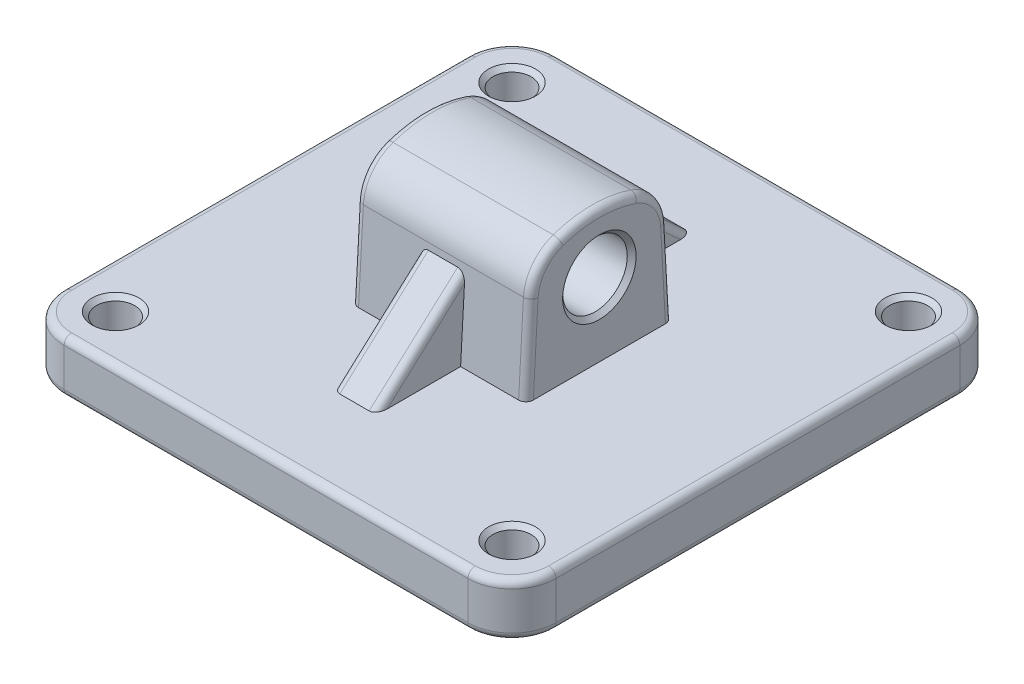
ISO-10303-21;
HEADER;
FILE_DESCRIPTION(('STEP AP214'),'2;1');
FILE_NAME('part.step','',(''),(''),'','','');
FILE_SCHEMA(('AUTOMOTIVE_DESIGN { 1 0 10303 214 1 1 1 1 }'));
ENDSEC;
DATA;
#1=APPLICATION_CONTEXT('core data for automotive mechanical design processes');
#2=APPLICATION_PROTOCOL_DEFINITION('international standard','automotive_design',2000,#1);
#3=PRODUCT_CONTEXT('',#1,'mechanical');
#4=PRODUCT('Part','Part','',(#3));
#5=PRODUCT_RELATED_PRODUCT_CATEGORY('part','',(#4));
#6=PRODUCT_DEFINITION_FORMATION('','',#4);
#7=PRODUCT_DEFINITION_CONTEXT('part definition',#1,'design');
#8=PRODUCT_DEFINITION('design','',#6,#7);
#9=PRODUCT_DEFINITION_SHAPE('','',#8);
#10=(LENGTH_UNIT() NAMED_UNIT(*) SI_UNIT(.MILLI.,.METRE.));
#11=(NAMED_UNIT(*) PLANE_ANGLE_UNIT() SI_UNIT($,.RADIAN.));
#12=(NAMED_UNIT(*) SI_UNIT($,.STERADIAN.) SOLID_ANGLE_UNIT());
#13=UNCERTAINTY_MEASURE_WITH_UNIT(LENGTH_MEASURE(1.E-05),#10,'distance_accuracy_value','');
#14=(GEOMETRIC_REPRESENTATION_CONTEXT(3) GLOBAL_UNCERTAINTY_ASSIGNED_CONTEXT((#13)) GLOBAL_UNIT_ASSIGNED_CONTEXT((#10,
#11,#12)) REPRESENTATION_CONTEXT('',''));
#15=CARTESIAN_POINT('',(0.,0.,0.));
#16=DIRECTION('',(0.,0.,1.));
#17=DIRECTION('',(1.,0.,0.));
#18=AXIS2_PLACEMENT_3D('',#15,#16,#17);
#19=CARTESIAN_POINT('',(-137.5,36.,-137.5));
#20=DIRECTION('',(0.,1.,0.));
#21=DIRECTION('',(0.,0.,1.));
#22=AXIS2_PLACEMENT_3D('',#19,#20,#21);
#23=PLANE('',#22);
#24=CARTESIAN_POINT('',(135.,36.,-135.));
#25=DIRECTION('',(0.,1.,0.));
#26=DIRECTION('',(0.,0.,1.));
#27=AXIS2_PLACEMENT_3D('',#24,#25,#26);
#28=CIRCLE('',#27,16.0000000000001);
#29=CARTESIAN_POINT('',(135.,36.,-119.));
#30=VERTEX_POINT('',#29);
#31=EDGE_CURVE('E11',#30,#30,#28,.F.);
#32=ORIENTED_EDGE('',*,*,#31,.T.);
#33=EDGE_LOOP('',(#32));
#34=FACE_BOUND('',#33,.T.);
#35=CARTESIAN_POINT('',(135.,36.,135.));
#36=DIRECTION('',(0.,1.,0.));
#37=DIRECTION('',(0.,0.,1.));
#38=AXIS2_PLACEMENT_3D('',#35,#36,#37);
#39=CIRCLE('',#38,16.0000000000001);
#40=CARTESIAN_POINT('',(135.,36.,151.));
#41=VERTEX_POINT('',#40);
#42=EDGE_CURVE('E45',#41,#41,#39,.F.);
#43=ORIENTED_EDGE('',*,*,#42,.T.);
#44=EDGE_LOOP('',(#43));
#45=FACE_BOUND('',#44,.T.);
#46=CARTESIAN_POINT('',(-135.,36.,135.));
#47=DIRECTION('',(0.,1.,0.));
#48=DIRECTION('',(0.,0.,1.));
#49=AXIS2_PLACEMENT_3D('',#46,#47,#48);
#50=CIRCLE('',#49,16.0000000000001);
#51=CARTESIAN_POINT('',(-135.,36.,151.));
#52=VERTEX_POINT('',#51);
#53=EDGE_CURVE('E649',#52,#52,#50,.F.);
#54=ORIENTED_EDGE('',*,*,#53,.T.);
#55=EDGE_LOOP('',(#54));
#56=FACE_BOUND('',#55,.T.);
#57=CARTESIAN_POINT('',(-135.,36.,-135.));
#58=DIRECTION('',(0.,1.,0.));
#59=DIRECTION('',(0.,0.,1.));
#60=AXIS2_PLACEMENT_3D('',#57,#58,#59);
#61=CIRCLE('',#60,16.);
#62=CARTESIAN_POINT('',(-135.,36.,-119.));
#63=VERTEX_POINT('',#62);
#64=EDGE_CURVE('E646',#63,#63,#61,.F.);
#65=ORIENTED_EDGE('',*,*,#64,.T.);
#66=EDGE_LOOP('',(#65));
#67=FACE_BOUND('',#66,.T.);
#68=DIRECTION('',(1.,0.,0.));
#69=VECTOR('',#68,1.);
#70=CARTESIAN_POINT('',(137.5,36.,162.5));
#71=LINE('',#70,#69);
#72=CARTESIAN_POINT('',(-137.5,36.,162.5));
#73=VERTEX_POINT('',#72);
#74=CARTESIAN_POINT('',(137.5,36.,162.5));
#75=VERTEX_POINT('',#74);
#76=EDGE_CURVE('E484',#73,#75,#71,.T.);
#77=ORIENTED_EDGE('',*,*,#76,.T.);
#78=CARTESIAN_POINT('',(137.5,36.,137.5));
#79=DIRECTION('',(0.,1.,0.));
#80=DIRECTION('',(0.,0.,1.));
#81=AXIS2_PLACEMENT_3D('',#78,#79,#80);
#82=CIRCLE('',#81,25.0000000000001);
#83=CARTESIAN_POINT('',(162.5,36.,137.5));
#84=VERTEX_POINT('',#83);
#85=EDGE_CURVE('E486',#75,#84,#82,.T.);
#86=ORIENTED_EDGE('',*,*,#85,.T.);
#87=DIRECTION('',(0.,0.,-1.));
#88=VECTOR('',#87,1.);
#89=CARTESIAN_POINT('',(162.5,36.,-137.5));
#90=LINE('',#89,#88);
#91=CARTESIAN_POINT('',(162.5,36.,-137.5));
#92=VERTEX_POINT('',#91);
#93=EDGE_CURVE('E472',#84,#92,#90,.T.);
#94=ORIENTED_EDGE('',*,*,#93,.T.);
#95=CARTESIAN_POINT('',(137.5,36.,-137.5));
#96=DIRECTION('',(0.,1.,0.));
#97=DIRECTION('',(0.,0.,1.));
#98=AXIS2_PLACEMENT_3D('',#95,#96,#97);
#99=CIRCLE('',#98,25.0000000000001);
#100=CARTESIAN_POINT('',(137.5,36.,-162.5));
#101=VERTEX_POINT('',#100);
#102=EDGE_CURVE('E474',#92,#101,#99,.T.);
#103=ORIENTED_EDGE('',*,*,#102,.T.);
#104=DIRECTION('',(-1.,0.,0.));
#105=VECTOR('',#104,1.);
#106=CARTESIAN_POINT('',(-137.5,36.,-162.5));
#107=LINE('',#106,#105);
#108=CARTESIAN_POINT('',(-137.5,36.,-162.5));
#109=VERTEX_POINT('',#108);
#110=EDGE_CURVE('E476',#101,#109,#107,.T.);
#111=ORIENTED_EDGE('',*,*,#110,.T.);
#112=CARTESIAN_POINT('',(-137.5,36.,-137.5));
#113=DIRECTION('',(0.,1.,0.));
#114=DIRECTION('',(0.,0.,1.));
#115=AXIS2_PLACEMENT_3D('',#112,#113,#114);
#116=CIRCLE('',#115,25.);
#117=CARTESIAN_POINT('',(-162.5,36.,-137.5));
#118=VERTEX_POINT('',#117);
#119=EDGE_CURVE('E478',#109,#118,#116,.T.);
#120=ORIENTED_EDGE('',*,*,#119,.T.);
#121=DIRECTION('',(0.,0.,1.));
#122=VECTOR('',#121,1.);
#123=CARTESIAN_POINT('',(-162.5,36.,137.5));
#124=LINE('',#123,#122);
#125=CARTESIAN_POINT('',(-162.5,36.,137.5));
#126=VERTEX_POINT('',#125);
#127=EDGE_CURVE('E480',#118,#126,#124,.T.);
#128=ORIENTED_EDGE('',*,*,#127,.T.);
#129=CARTESIAN_POINT('',(-137.5,36.,137.5));
#130=DIRECTION('',(0.,1.,0.));
#131=DIRECTION('',(0.,0.,1.));
#132=AXIS2_PLACEMENT_3D('',#129,#130,#131);
#133=CIRCLE('',#132,25.);
#134=EDGE_CURVE('E482',#126,#73,#133,.T.);
#135=ORIENTED_EDGE('',*,*,#134,.T.);
#136=EDGE_LOOP('',(#77,#86,#94,#103,#111,#120,#128,#135));
#137=FACE_BOUND('',#136,.T.);
#138=DIRECTION('',(1.,0.,0.));
#139=VECTOR('',#138,1.);
#140=CARTESIAN_POINT('',(-137.5,36.,-107.293022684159));
#141=LINE('',#140,#139);
#142=CARTESIAN_POINT('',(10.,36.,-107.293022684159));
#143=VERTEX_POINT('',#142);
#144=CARTESIAN_POINT('',(-10.,36.,-107.293022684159));
#145=VERTEX_POINT('',#144);
#146=EDGE_CURVE('E334',#143,#145,#141,.F.);
#147=ORIENTED_EDGE('',*,*,#146,.F.);
#148=CARTESIAN_POINT('',(10.,36.,-99.8427090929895));
#149=DIRECTION('',(0.,1.,0.));
#150=DIRECTION('',(0.,0.,1.));
#151=AXIS2_PLACEMENT_3D('',#148,#149,#150);
#152=ELLIPSE('',#151,7.4503135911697,5.);
#153=CARTESIAN_POINT('',(15.,36.,-99.8427090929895));
#154=VERTEX_POINT('',#153);
#155=EDGE_CURVE('E526',#143,#154,#152,.F.);
#156=ORIENTED_EDGE('',*,*,#155,.T.);
#157=DIRECTION('',(0.,0.,-1.));
#158=VECTOR('',#157,1.);
#159=CARTESIAN_POINT('',(15.,36.,-137.5));
#160=LINE('',#159,#158);
#161=CARTESIAN_POINT('',(15.,36.,-50.));
#162=VERTEX_POINT('',#161);
#163=EDGE_CURVE('E327',#162,#154,#160,.T.);
#164=ORIENTED_EDGE('',*,*,#163,.F.);
#165=DIRECTION('',(1.,0.,0.));
#166=VECTOR('',#165,1.);
#167=CARTESIAN_POINT('',(-59.5,36.,-50.));
#168=LINE('',#167,#166);
#169=CARTESIAN_POINT('',(54.5,36.,-50.));
#170=VERTEX_POINT('',#169);
#171=EDGE_CURVE('E292',#162,#170,#168,.T.);
#172=ORIENTED_EDGE('',*,*,#171,.T.);
#173=CARTESIAN_POINT('',(54.5,36.,-44.992310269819));
#174=DIRECTION('',(0.,1.,0.));
#175=DIRECTION('',(0.,0.,1.));
#176=AXIS2_PLACEMENT_3D('',#173,#174,#175);
#177=ELLIPSE('',#176,5.00768973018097,5.);
#178=CARTESIAN_POINT('',(59.5,36.,-44.992310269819));
#179=VERTEX_POINT('',#178);
#180=EDGE_CURVE('E516',#170,#179,#177,.F.);
#181=ORIENTED_EDGE('',*,*,#180,.T.);
#182=DIRECTION('',(0.,0.,-1.));
#183=VECTOR('',#182,1.);
#184=CARTESIAN_POINT('',(59.5,36.,50.));
#185=LINE('',#184,#183);
#186=CARTESIAN_POINT('',(59.5,36.,44.9923102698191));
#187=VERTEX_POINT('',#186);
#188=EDGE_CURVE('E337',#187,#179,#185,.T.);
#189=ORIENTED_EDGE('',*,*,#188,.F.);
#190=CARTESIAN_POINT('',(54.5,36.,44.9923102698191));
#191=DIRECTION('',(0.,1.,0.));
#192=DIRECTION('',(0.,0.,1.));
#193=AXIS2_PLACEMENT_3D('',#190,#191,#192);
#194=ELLIPSE('',#193,5.00768973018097,5.);
#195=CARTESIAN_POINT('',(54.5,36.,50.));
#196=VERTEX_POINT('',#195);
#197=EDGE_CURVE('E520',#187,#196,#194,.F.);
#198=ORIENTED_EDGE('',*,*,#197,.T.);
#199=DIRECTION('',(1.,0.,0.));
#200=VECTOR('',#199,1.);
#201=CARTESIAN_POINT('',(-59.5,36.,50.));
#202=LINE('',#201,#200);
#203=CARTESIAN_POINT('',(15.,36.,50.));
#204=VERTEX_POINT('',#203);
#205=EDGE_CURVE('E293',#204,#196,#202,.T.);
#206=ORIENTED_EDGE('',*,*,#205,.F.);
#207=DIRECTION('',(0.,0.,-1.));
#208=VECTOR('',#207,1.);
#209=CARTESIAN_POINT('',(15.,36.,-137.5));
#210=LINE('',#209,#208);
#211=CARTESIAN_POINT('',(15.,36.,99.8427090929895));
#212=VERTEX_POINT('',#211);
#213=EDGE_CURVE('E312',#212,#204,#210,.T.);
#214=ORIENTED_EDGE('',*,*,#213,.F.);
#215=CARTESIAN_POINT('',(10.,36.,99.8427090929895));
#216=DIRECTION('',(0.,1.,0.));
#217=DIRECTION('',(0.,0.,1.));
#218=AXIS2_PLACEMENT_3D('',#215,#216,#217);
#219=ELLIPSE('',#218,7.4503135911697,5.);
#220=CARTESIAN_POINT('',(10.,36.,107.293022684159));
#221=VERTEX_POINT('',#220);
#222=EDGE_CURVE('E532',#212,#221,#219,.F.);
#223=ORIENTED_EDGE('',*,*,#222,.T.);
#224=DIRECTION('',(1.,0.,0.));
#225=VECTOR('',#224,1.);
#226=CARTESIAN_POINT('',(-137.5,36.,107.293022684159));
#227=LINE('',#226,#225);
#228=CARTESIAN_POINT('',(-10.,36.,107.293022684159));
#229=VERTEX_POINT('',#228);
#230=EDGE_CURVE('E318',#229,#221,#227,.T.);
#231=ORIENTED_EDGE('',*,*,#230,.F.);
#232=CARTESIAN_POINT('',(-10.,36.,99.8427090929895));
#233=DIRECTION('',(0.,1.,0.));
#234=DIRECTION('',(0.,0.,-1.));
#235=AXIS2_PLACEMENT_3D('',#232,#233,#234);
#236=ELLIPSE('',#235,7.4503135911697,5.);
#237=CARTESIAN_POINT('',(-15.,36.,99.8427090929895));
#238=VERTEX_POINT('',#237);
#239=EDGE_CURVE('E299',#229,#238,#236,.F.);
#240=ORIENTED_EDGE('',*,*,#239,.T.);
#241=DIRECTION('',(0.,0.,-1.));
#242=VECTOR('',#241,1.);
#243=CARTESIAN_POINT('',(-15.,36.,-137.5));
#244=LINE('',#243,#242);
#245=CARTESIAN_POINT('',(-15.,36.,50.));
#246=VERTEX_POINT('',#245);
#247=EDGE_CURVE('E296',#238,#246,#244,.T.);
#248=ORIENTED_EDGE('',*,*,#247,.T.);
#249=CARTESIAN_POINT('',(-54.5,36.,50.));
#250=VERTEX_POINT('',#249);
#251=EDGE_CURVE('E282',#250,#246,#202,.T.);
#252=ORIENTED_EDGE('',*,*,#251,.F.);
#253=CARTESIAN_POINT('',(-54.5,36.,44.9923102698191));
#254=DIRECTION('',(0.,1.,0.));
#255=DIRECTION('',(0.,0.,-1.));
#256=AXIS2_PLACEMENT_3D('',#253,#254,#255);
#257=ELLIPSE('',#256,5.00768973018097,5.);
#258=CARTESIAN_POINT('',(-59.5,36.,44.9923102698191));
#259=VERTEX_POINT('',#258);
#260=EDGE_CURVE('E518',#250,#259,#257,.F.);
#261=ORIENTED_EDGE('',*,*,#260,.T.);
#262=DIRECTION('',(0.,0.,-1.));
#263=VECTOR('',#262,1.);
#264=CARTESIAN_POINT('',(-59.5,36.,50.));
#265=LINE('',#264,#263);
#266=CARTESIAN_POINT('',(-59.5,36.,-44.992310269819));
#267=VERTEX_POINT('',#266);
#268=EDGE_CURVE('E338',#259,#267,#265,.T.);
#269=ORIENTED_EDGE('',*,*,#268,.T.);
#270=CARTESIAN_POINT('',(-54.5,36.,-44.992310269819));
#271=DIRECTION('',(0.,1.,0.));
#272=DIRECTION('',(0.,0.,-1.));
#273=AXIS2_PLACEMENT_3D('',#270,#271,#272);
#274=ELLIPSE('',#273,5.00768973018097,5.);
#275=CARTESIAN_POINT('',(-54.5,36.,-50.));
#276=VERTEX_POINT('',#275);
#277=EDGE_CURVE('E514',#267,#276,#274,.F.);
#278=ORIENTED_EDGE('',*,*,#277,.T.);
#279=CARTESIAN_POINT('',(-15.,36.,-50.));
#280=VERTEX_POINT('',#279);
#281=EDGE_CURVE('E348',#276,#280,#168,.T.);
#282=ORIENTED_EDGE('',*,*,#281,.T.);
#283=DIRECTION('',(0.,0.,-1.));
#284=VECTOR('',#283,1.);
#285=CARTESIAN_POINT('',(-15.,36.,-137.5));
#286=LINE('',#285,#284);
#287=CARTESIAN_POINT('',(-15.,36.,-99.8427090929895));
#288=VERTEX_POINT('',#287);
#289=EDGE_CURVE('E321',#280,#288,#286,.T.);
#290=ORIENTED_EDGE('',*,*,#289,.T.);
#291=CARTESIAN_POINT('',(-10.,36.,-99.8427090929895));
#292=DIRECTION('',(0.,1.,0.));
#293=DIRECTION('',(0.,0.,-1.));
#294=AXIS2_PLACEMENT_3D('',#291,#292,#293);
#295=ELLIPSE('',#294,7.4503135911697,5.);
#296=EDGE_CURVE('E522',#288,#145,#295,.F.);
#297=ORIENTED_EDGE('',*,*,#296,.T.);
#298=EDGE_LOOP('',(#147,#156,#164,#172,#181,#189,#198,#206,#214,#223,#231,#240,#248,#252,#261,
#269,#278,#282,#290,#297));
#299=FACE_BOUND('',#298,.T.);
#300=ADVANCED_FACE('F37',(#34,#45,#56,#67,#137,#299),#23,.T.);
#301=CARTESIAN_POINT('',(-137.5,0.,-137.5));
#302=DIRECTION('',(0.,1.,0.));
#303=DIRECTION('',(0.,0.,1.));
#304=AXIS2_PLACEMENT_3D('',#301,#302,#303);
#305=PLANE('',#304);
#306=CARTESIAN_POINT('',(-135.,0.,-135.));
#307=DIRECTION('',(0.,1.,0.));
#308=DIRECTION('',(0.,0.,1.));
#309=AXIS2_PLACEMENT_3D('',#306,#307,#308);
#310=CIRCLE('',#309,16.);
#311=CARTESIAN_POINT('',(-135.,0.,-119.));
#312=VERTEX_POINT('',#311);
#313=EDGE_CURVE('E619',#312,#312,#310,.T.);
#314=ORIENTED_EDGE('',*,*,#313,.T.);
#315=EDGE_LOOP('',(#314));
#316=FACE_BOUND('',#315,.T.);
#317=CARTESIAN_POINT('',(135.,0.,-135.));
#318=DIRECTION('',(0.,1.,0.));
#319=DIRECTION('',(0.,0.,1.));
#320=AXIS2_PLACEMENT_3D('',#317,#318,#319);
#321=CIRCLE('',#320,16.);
#322=CARTESIAN_POINT('',(135.,0.,-119.));
#323=VERTEX_POINT('',#322);
#324=EDGE_CURVE('E616',#323,#323,#321,.T.);
#325=ORIENTED_EDGE('',*,*,#324,.T.);
#326=EDGE_LOOP('',(#325));
#327=FACE_BOUND('',#326,.T.);
#328=CARTESIAN_POINT('',(135.,0.,135.));
#329=DIRECTION('',(0.,1.,0.));
#330=DIRECTION('',(0.,0.,1.));
#331=AXIS2_PLACEMENT_3D('',#328,#329,#330);
#332=CIRCLE('',#331,16.);
#333=CARTESIAN_POINT('',(135.,0.,151.));
#334=VERTEX_POINT('',#333);
#335=EDGE_CURVE('E613',#334,#334,#332,.T.);
#336=ORIENTED_EDGE('',*,*,#335,.T.);
#337=EDGE_LOOP('',(#336));
#338=FACE_BOUND('',#337,.T.);
#339=CARTESIAN_POINT('',(-135.,0.,135.));
#340=DIRECTION('',(0.,1.,0.));
#341=DIRECTION('',(0.,0.,1.));
#342=AXIS2_PLACEMENT_3D('',#339,#340,#341);
#343=CIRCLE('',#342,16.);
#344=CARTESIAN_POINT('',(-135.,0.,151.));
#345=VERTEX_POINT('',#344);
#346=EDGE_CURVE('E610',#345,#345,#343,.T.);
#347=ORIENTED_EDGE('',*,*,#346,.T.);
#348=EDGE_LOOP('',(#347));
#349=FACE_BOUND('',#348,.T.);
#350=DIRECTION('',(0.,0.,-1.));
#351=VECTOR('',#350,1.);
#352=CARTESIAN_POINT('',(162.5,0.,-137.5));
#353=LINE('',#352,#351);
#354=CARTESIAN_POINT('',(162.5,0.,-137.5));
#355=VERTEX_POINT('',#354);
#356=CARTESIAN_POINT('',(162.5,0.,137.5));
#357=VERTEX_POINT('',#356);
#358=EDGE_CURVE('E431',#355,#357,#353,.F.);
#359=ORIENTED_EDGE('',*,*,#358,.T.);
#360=CARTESIAN_POINT('',(137.5,0.,137.5));
#361=DIRECTION('',(0.,1.,0.));
#362=DIRECTION('',(0.,0.,1.));
#363=AXIS2_PLACEMENT_3D('',#360,#361,#362);
#364=CIRCLE('',#363,25.0000000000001);
#365=CARTESIAN_POINT('',(137.5,0.,162.5));
#366=VERTEX_POINT('',#365);
#367=EDGE_CURVE('E445',#357,#366,#364,.F.);
#368=ORIENTED_EDGE('',*,*,#367,.T.);
#369=DIRECTION('',(1.,0.,0.));
#370=VECTOR('',#369,1.);
#371=CARTESIAN_POINT('',(-137.5,0.,162.5));
#372=LINE('',#371,#370);
#373=CARTESIAN_POINT('',(-137.5,0.,162.5));
#374=VERTEX_POINT('',#373);
#375=EDGE_CURVE('E443',#366,#374,#372,.F.);
#376=ORIENTED_EDGE('',*,*,#375,.T.);
#377=CARTESIAN_POINT('',(-137.5,0.,137.5));
#378=DIRECTION('',(0.,1.,0.));
#379=DIRECTION('',(0.,0.,1.));
#380=AXIS2_PLACEMENT_3D('',#377,#378,#379);
#381=CIRCLE('',#380,25.);
#382=CARTESIAN_POINT('',(-162.5,0.,137.5));
#383=VERTEX_POINT('',#382);
#384=EDGE_CURVE('E441',#374,#383,#381,.F.);
#385=ORIENTED_EDGE('',*,*,#384,.T.);
#386=DIRECTION('',(0.,0.,1.));
#387=VECTOR('',#386,1.);
#388=CARTESIAN_POINT('',(-162.5,0.,-137.5));
#389=LINE('',#388,#387);
#390=CARTESIAN_POINT('',(-162.5,0.,-137.5));
#391=VERTEX_POINT('',#390);
#392=EDGE_CURVE('E439',#383,#391,#389,.F.);
#393=ORIENTED_EDGE('',*,*,#392,.T.);
#394=CARTESIAN_POINT('',(-137.5,0.,-137.5));
#395=DIRECTION('',(0.,1.,0.));
#396=DIRECTION('',(0.,0.,1.));
#397=AXIS2_PLACEMENT_3D('',#394,#395,#396);
#398=CIRCLE('',#397,25.);
#399=CARTESIAN_POINT('',(-137.5,0.,-162.5));
#400=VERTEX_POINT('',#399);
#401=EDGE_CURVE('E437',#391,#400,#398,.F.);
#402=ORIENTED_EDGE('',*,*,#401,.T.);
#403=DIRECTION('',(-1.,0.,0.));
#404=VECTOR('',#403,1.);
#405=CARTESIAN_POINT('',(-137.5,0.,-162.5));
#406=LINE('',#405,#404);
#407=CARTESIAN_POINT('',(137.5,0.,-162.5));
#408=VERTEX_POINT('',#407);
#409=EDGE_CURVE('E435',#400,#408,#406,.F.);
#410=ORIENTED_EDGE('',*,*,#409,.T.);
#411=CARTESIAN_POINT('',(137.5,0.,-137.5));
#412=DIRECTION('',(0.,1.,0.));
#413=DIRECTION('',(0.,0.,1.));
#414=AXIS2_PLACEMENT_3D('',#411,#412,#413);
#415=CIRCLE('',#414,25.0000000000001);
#416=EDGE_CURVE('E433',#408,#355,#415,.F.);
#417=ORIENTED_EDGE('',*,*,#416,.T.);
#418=EDGE_LOOP('',(#359,#368,#376,#385,#393,#402,#410,#417));
#419=FACE_BOUND('',#418,.T.);
#420=CARTESIAN_POINT('',(0.,0.,0.));
#421=DIRECTION('',(0.,-1.,0.));
#422=DIRECTION('',(0.,0.,-1.));
#423=AXIS2_PLACEMENT_3D('',#420,#421,#422);
#424=CIRCLE('',#423,120.);
#425=CARTESIAN_POINT('',(0.,0.,-120.));
#426=VERTEX_POINT('',#425);
#427=EDGE_CURVE('E347',#426,#426,#424,.T.);
#428=ORIENTED_EDGE('',*,*,#427,.F.);
#429=EDGE_LOOP('',(#428));
#430=FACE_BOUND('',#429,.T.);
#431=ADVANCED_FACE('F681',(#316,#327,#338,#349,#419,#430),#305,.F.);
#432=CARTESIAN_POINT('',(-137.5,36.,-137.5));
#433=DIRECTION('',(0.,-1.,0.));
#434=DIRECTION('',(0.,0.,-1.));
#435=AXIS2_PLACEMENT_3D('',#432,#433,#434);
#436=CYLINDRICAL_SURFACE('',#435,30.);
#437=DIRECTION('',(0.,-1.,0.));
#438=VECTOR('',#437,1.);
#439=CARTESIAN_POINT('',(-137.5,36.,-167.5));
#440=LINE('',#439,#438);
#441=CARTESIAN_POINT('',(-137.5,31.,-167.5));
#442=VERTEX_POINT('',#441);
#443=CARTESIAN_POINT('',(-137.5,5.,-167.5));
#444=VERTEX_POINT('',#443);
#445=EDGE_CURVE('E363',#442,#444,#440,.T.);
#446=ORIENTED_EDGE('',*,*,#445,.T.);
#447=CARTESIAN_POINT('',(-137.5,5.,-137.5));
#448=DIRECTION('',(0.,1.,0.));
#449=DIRECTION('',(0.,0.,1.));
#450=AXIS2_PLACEMENT_3D('',#447,#448,#449);
#451=CIRCLE('',#450,30.);
#452=CARTESIAN_POINT('',(-167.5,5.,-137.5));
#453=VERTEX_POINT('',#452);
#454=EDGE_CURVE('E462',#444,#453,#451,.T.);
#455=ORIENTED_EDGE('',*,*,#454,.T.);
#456=DIRECTION('',(0.,-1.,0.));
#457=VECTOR('',#456,1.);
#458=CARTESIAN_POINT('',(-167.5,36.,-137.5));
#459=LINE('',#458,#457);
#460=CARTESIAN_POINT('',(-167.5,31.,-137.5));
#461=VERTEX_POINT('',#460);
#462=EDGE_CURVE('E384',#461,#453,#459,.T.);
#463=ORIENTED_EDGE('',*,*,#462,.F.);
#464=CARTESIAN_POINT('',(-137.5,31.,-137.5));
#465=DIRECTION('',(0.,1.,0.));
#466=DIRECTION('',(0.,0.,1.));
#467=AXIS2_PLACEMENT_3D('',#464,#465,#466);
#468=CIRCLE('',#467,30.);
#469=EDGE_CURVE('E460',#461,#442,#468,.F.);
#470=ORIENTED_EDGE('',*,*,#469,.T.);
#471=EDGE_LOOP('',(#446,#455,#463,#470));
#472=FACE_BOUND('',#471,.T.);
#473=ADVANCED_FACE('F687',(#472),#436,.T.);
#474=CARTESIAN_POINT('',(-167.5,36.,-137.5));
#475=DIRECTION('',(1.,0.,0.));
#476=DIRECTION('',(0.,0.,-1.));
#477=AXIS2_PLACEMENT_3D('',#474,#475,#476);
#478=PLANE('',#477);
#479=ORIENTED_EDGE('',*,*,#462,.T.);
#480=DIRECTION('',(0.,0.,1.));
#481=VECTOR('',#480,1.);
#482=CARTESIAN_POINT('',(-167.5,5.,-137.5));
#483=LINE('',#482,#481);
#484=CARTESIAN_POINT('',(-167.5,5.,137.5));
#485=VERTEX_POINT('',#484);
#486=EDGE_CURVE('E458',#453,#485,#483,.T.);
#487=ORIENTED_EDGE('',*,*,#486,.T.);
#488=DIRECTION('',(0.,-1.,0.));
#489=VECTOR('',#488,1.);
#490=CARTESIAN_POINT('',(-167.5,36.,137.5));
#491=LINE('',#490,#489);
#492=CARTESIAN_POINT('',(-167.5,31.,137.5));
#493=VERTEX_POINT('',#492);
#494=EDGE_CURVE('E381',#493,#485,#491,.T.);
#495=ORIENTED_EDGE('',*,*,#494,.F.);
#496=DIRECTION('',(0.,0.,1.));
#497=VECTOR('',#496,1.);
#498=CARTESIAN_POINT('',(-167.5,31.,-137.5));
#499=LINE('',#498,#497);
#500=EDGE_CURVE('E456',#493,#461,#499,.F.);
#501=ORIENTED_EDGE('',*,*,#500,.T.);
#502=EDGE_LOOP('',(#479,#487,#495,#501));
#503=FACE_BOUND('',#502,.T.);
#504=ADVANCED_FACE('F715',(#503),#478,.F.);
#505=CARTESIAN_POINT('',(-137.5,36.,137.5));
#506=DIRECTION('',(0.,-1.,0.));
#507=DIRECTION('',(0.,0.,-1.));
#508=AXIS2_PLACEMENT_3D('',#505,#506,#507);
#509=CYLINDRICAL_SURFACE('',#508,30.);
#510=ORIENTED_EDGE('',*,*,#494,.T.);
#511=CARTESIAN_POINT('',(-137.5,5.,137.5));
#512=DIRECTION('',(0.,1.,0.));
#513=DIRECTION('',(0.,0.,1.));
#514=AXIS2_PLACEMENT_3D('',#511,#512,#513);
#515=CIRCLE('',#514,30.);
#516=CARTESIAN_POINT('',(-137.5,5.,167.5));
#517=VERTEX_POINT('',#516);
#518=EDGE_CURVE('E454',#485,#517,#515,.T.);
#519=ORIENTED_EDGE('',*,*,#518,.T.);
#520=DIRECTION('',(0.,-1.,0.));
#521=VECTOR('',#520,1.);
#522=CARTESIAN_POINT('',(-137.5,36.,167.5));
#523=LINE('',#522,#521);
#524=CARTESIAN_POINT('',(-137.5,31.,167.5));
#525=VERTEX_POINT('',#524);
#526=EDGE_CURVE('E378',#525,#517,#523,.T.);
#527=ORIENTED_EDGE('',*,*,#526,.F.);
#528=CARTESIAN_POINT('',(-137.5,31.,137.5));
#529=DIRECTION('',(0.,1.,0.));
#530=DIRECTION('',(0.,0.,1.));
#531=AXIS2_PLACEMENT_3D('',#528,#529,#530);
#532=CIRCLE('',#531,30.);
#533=EDGE_CURVE('E452',#525,#493,#532,.F.);
#534=ORIENTED_EDGE('',*,*,#533,.T.);
#535=EDGE_LOOP('',(#510,#519,#527,#534));
#536=FACE_BOUND('',#535,.T.);
#537=ADVANCED_FACE('F711',(#536),#509,.T.);
#538=CARTESIAN_POINT('',(-137.5,36.,167.5));
#539=DIRECTION('',(0.,0.,-1.));
#540=DIRECTION('',(-1.,0.,0.));
#541=AXIS2_PLACEMENT_3D('',#538,#539,#540);
#542=PLANE('',#541);
#543=ORIENTED_EDGE('',*,*,#526,.T.);
#544=DIRECTION('',(1.,0.,0.));
#545=VECTOR('',#544,1.);
#546=CARTESIAN_POINT('',(-137.5,5.,167.5));
#547=LINE('',#546,#545);
#548=CARTESIAN_POINT('',(137.5,5.,167.5));
#549=VERTEX_POINT('',#548);
#550=EDGE_CURVE('E450',#517,#549,#547,.T.);
#551=ORIENTED_EDGE('',*,*,#550,.T.);
#552=DIRECTION('',(0.,-1.,0.));
#553=VECTOR('',#552,1.);
#554=CARTESIAN_POINT('',(137.5,36.,167.5));
#555=LINE('',#554,#553);
#556=CARTESIAN_POINT('',(137.5,31.,167.5));
#557=VERTEX_POINT('',#556);
#558=EDGE_CURVE('E375',#557,#549,#555,.T.);
#559=ORIENTED_EDGE('',*,*,#558,.F.);
#560=DIRECTION('',(1.,0.,0.));
#561=VECTOR('',#560,1.);
#562=CARTESIAN_POINT('',(-137.5,31.,167.5));
#563=LINE('',#562,#561);
#564=EDGE_CURVE('E448',#557,#525,#563,.F.);
#565=ORIENTED_EDGE('',*,*,#564,.T.);
#566=EDGE_LOOP('',(#543,#551,#559,#565));
#567=FACE_BOUND('',#566,.T.);
#568=ADVANCED_FACE('F707',(#567),#542,.F.);
#569=CARTESIAN_POINT('',(137.5,36.,137.5));
#570=DIRECTION('',(0.,-1.,0.));
#571=DIRECTION('',(0.,0.,-1.));
#572=AXIS2_PLACEMENT_3D('',#569,#570,#571);
#573=CYLINDRICAL_SURFACE('',#572,30.0000000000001);
#574=ORIENTED_EDGE('',*,*,#558,.T.);
#575=CARTESIAN_POINT('',(137.5,5.,137.5));
#576=DIRECTION('',(0.,1.,0.));
#577=DIRECTION('',(0.,0.,1.));
#578=AXIS2_PLACEMENT_3D('',#575,#576,#577);
#579=CIRCLE('',#578,30.0000000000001);
#580=CARTESIAN_POINT('',(167.5,5.,137.5));
#581=VERTEX_POINT('',#580);
#582=EDGE_CURVE('E428',#549,#581,#579,.T.);
#583=ORIENTED_EDGE('',*,*,#582,.T.);
#584=DIRECTION('',(0.,-1.,0.));
#585=VECTOR('',#584,1.);
#586=CARTESIAN_POINT('',(167.5,36.,137.5));
#587=LINE('',#586,#585);
#588=CARTESIAN_POINT('',(167.5,31.,137.5));
#589=VERTEX_POINT('',#588);
#590=EDGE_CURVE('E372',#589,#581,#587,.T.);
#591=ORIENTED_EDGE('',*,*,#590,.F.);
#592=CARTESIAN_POINT('',(137.5,31.,137.5));
#593=DIRECTION('',(0.,1.,0.));
#594=DIRECTION('',(0.,0.,1.));
#595=AXIS2_PLACEMENT_3D('',#592,#593,#594);
#596=CIRCLE('',#595,30.0000000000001);
#597=EDGE_CURVE('E425',#589,#557,#596,.F.);
#598=ORIENTED_EDGE('',*,*,#597,.T.);
#599=EDGE_LOOP('',(#574,#583,#591,#598));
#600=FACE_BOUND('',#599,.T.);
#601=ADVANCED_FACE('F703',(#600),#573,.T.);
#602=CARTESIAN_POINT('',(167.5,36.,-137.5));
#603=DIRECTION('',(-1.,0.,0.));
#604=DIRECTION('',(0.,0.,1.));
#605=AXIS2_PLACEMENT_3D('',#602,#603,#604);
#606=PLANE('',#605);
#607=ORIENTED_EDGE('',*,*,#590,.T.);
#608=DIRECTION('',(0.,0.,-1.));
#609=VECTOR('',#608,1.);
#610=CARTESIAN_POINT('',(167.5,5.,-137.5));
#611=LINE('',#610,#609);
#612=CARTESIAN_POINT('',(167.5,5.,-137.5));
#613=VERTEX_POINT('',#612);
#614=EDGE_CURVE('E512',#581,#613,#611,.T.);
#615=ORIENTED_EDGE('',*,*,#614,.T.);
#616=DIRECTION('',(0.,-1.,0.));
#617=VECTOR('',#616,1.);
#618=CARTESIAN_POINT('',(167.5,36.,-137.5));
#619=LINE('',#618,#617);
#620=CARTESIAN_POINT('',(167.5,31.,-137.5));
#621=VERTEX_POINT('',#620);
#622=EDGE_CURVE('E369',#621,#613,#619,.T.);
#623=ORIENTED_EDGE('',*,*,#622,.F.);
#624=DIRECTION('',(0.,0.,-1.));
#625=VECTOR('',#624,1.);
#626=CARTESIAN_POINT('',(167.5,31.,137.5));
#627=LINE('',#626,#625);
#628=EDGE_CURVE('E510',#621,#589,#627,.F.);
#629=ORIENTED_EDGE('',*,*,#628,.T.);
#630=EDGE_LOOP('',(#607,#615,#623,#629));
#631=FACE_BOUND('',#630,.T.);
#632=ADVANCED_FACE('F699',(#631),#606,.F.);
#633=CARTESIAN_POINT('',(137.5,36.,-137.5));
#634=DIRECTION('',(0.,-1.,0.));
#635=DIRECTION('',(0.,0.,-1.));
#636=AXIS2_PLACEMENT_3D('',#633,#634,#635);
#637=CYLINDRICAL_SURFACE('',#636,30.0000000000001);
#638=ORIENTED_EDGE('',*,*,#622,.T.);
#639=CARTESIAN_POINT('',(137.5,5.,-137.5));
#640=DIRECTION('',(0.,1.,0.));
#641=DIRECTION('',(0.,0.,1.));
#642=AXIS2_PLACEMENT_3D('',#639,#640,#641);
#643=CIRCLE('',#642,30.0000000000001);
#644=CARTESIAN_POINT('',(137.5,5.,-167.5));
#645=VERTEX_POINT('',#644);
#646=EDGE_CURVE('E470',#613,#645,#643,.T.);
#647=ORIENTED_EDGE('',*,*,#646,.T.);
#648=DIRECTION('',(0.,-1.,0.));
#649=VECTOR('',#648,1.);
#650=CARTESIAN_POINT('',(137.5,36.,-167.5));
#651=LINE('',#650,#649);
#652=CARTESIAN_POINT('',(137.5,31.,-167.5));
#653=VERTEX_POINT('',#652);
#654=EDGE_CURVE('E366',#653,#645,#651,.T.);
#655=ORIENTED_EDGE('',*,*,#654,.F.);
#656=CARTESIAN_POINT('',(137.5,31.,-137.5));
#657=DIRECTION('',(0.,1.,0.));
#658=DIRECTION('',(0.,0.,1.));
#659=AXIS2_PLACEMENT_3D('',#656,#657,#658);
#660=CIRCLE('',#659,30.0000000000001);
#661=EDGE_CURVE('E468',#653,#621,#660,.F.);
#662=ORIENTED_EDGE('',*,*,#661,.T.);
#663=EDGE_LOOP('',(#638,#647,#655,#662));
#664=FACE_BOUND('',#663,.T.);
#665=ADVANCED_FACE('F695',(#664),#637,.T.);
#666=CARTESIAN_POINT('',(-137.5,36.,-167.5));
#667=DIRECTION('',(0.,0.,1.));
#668=DIRECTION('',(1.,0.,0.));
#669=AXIS2_PLACEMENT_3D('',#666,#667,#668);
#670=PLANE('',#669);
#671=ORIENTED_EDGE('',*,*,#654,.T.);
#672=DIRECTION('',(-1.,0.,0.));
#673=VECTOR('',#672,1.);
#674=CARTESIAN_POINT('',(-137.5,5.,-167.5));
#675=LINE('',#674,#673);
#676=EDGE_CURVE('E466',#645,#444,#675,.T.);
#677=ORIENTED_EDGE('',*,*,#676,.T.);
#678=ORIENTED_EDGE('',*,*,#445,.F.);
#679=DIRECTION('',(-1.,0.,0.));
#680=VECTOR('',#679,1.);
#681=CARTESIAN_POINT('',(137.5,31.,-167.5));
#682=LINE('',#681,#680);
#683=EDGE_CURVE('E464',#442,#653,#682,.F.);
#684=ORIENTED_EDGE('',*,*,#683,.T.);
#685=EDGE_LOOP('',(#671,#677,#678,#684));
#686=FACE_BOUND('',#685,.T.);
#687=ADVANCED_FACE('F692',(#686),#670,.F.);
#688=CARTESIAN_POINT('',(-135.,36.,-135.));
#689=DIRECTION('',(0.,-1.,0.));
#690=DIRECTION('',(0.,0.,-1.));
#691=AXIS2_PLACEMENT_3D('',#688,#689,#690);
#692=CYLINDRICAL_SURFACE('',#691,13.);
#693=CARTESIAN_POINT('',(-135.,3.,-135.));
#694=DIRECTION('',(0.,1.,0.));
#695=DIRECTION('',(0.,0.,1.));
#696=AXIS2_PLACEMENT_3D('',#693,#694,#695);
#697=CIRCLE('',#696,13.);
#698=CARTESIAN_POINT('',(-135.,3.,-122.));
#699=VERTEX_POINT('',#698);
#700=EDGE_CURVE('E625',#699,#699,#697,.F.);
#701=ORIENTED_EDGE('',*,*,#700,.T.);
#702=EDGE_LOOP('',(#701));
#703=FACE_BOUND('',#702,.T.);
#704=CARTESIAN_POINT('',(-135.,33.0000000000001,-135.));
#705=DIRECTION('',(0.,1.,0.));
#706=DIRECTION('',(0.,0.,1.));
#707=AXIS2_PLACEMENT_3D('',#704,#705,#706);
#708=CIRCLE('',#707,13.);
#709=CARTESIAN_POINT('',(-135.,33.0000000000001,-122.));
#710=VERTEX_POINT('',#709);
#711=EDGE_CURVE('E622',#710,#710,#708,.T.);
#712=ORIENTED_EDGE('',*,*,#711,.T.);
#713=EDGE_LOOP('',(#712));
#714=FACE_BOUND('',#713,.T.);
#715=ADVANCED_FACE('F677',(#703,#714),#692,.F.);
#716=CARTESIAN_POINT('',(135.,36.,-135.));
#717=DIRECTION('',(0.,-1.,0.));
#718=DIRECTION('',(0.,0.,-1.));
#719=AXIS2_PLACEMENT_3D('',#716,#717,#718);
#720=CYLINDRICAL_SURFACE('',#719,13.);
#721=CARTESIAN_POINT('',(135.,3.00000000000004,-135.));
#722=DIRECTION('',(0.,1.,0.));
#723=DIRECTION('',(0.,0.,1.));
#724=AXIS2_PLACEMENT_3D('',#721,#722,#723);
#725=CIRCLE('',#724,13.);
#726=CARTESIAN_POINT('',(135.,3.00000000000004,-122.));
#727=VERTEX_POINT('',#726);
#728=EDGE_CURVE('E631',#727,#727,#725,.F.);
#729=ORIENTED_EDGE('',*,*,#728,.T.);
#730=EDGE_LOOP('',(#729));
#731=FACE_BOUND('',#730,.T.);
#732=CARTESIAN_POINT('',(135.,33.,-135.));
#733=DIRECTION('',(0.,1.,0.));
#734=DIRECTION('',(0.,0.,1.));
#735=AXIS2_PLACEMENT_3D('',#732,#733,#734);
#736=CIRCLE('',#735,13.);
#737=CARTESIAN_POINT('',(135.,33.,-122.));
#738=VERTEX_POINT('',#737);
#739=EDGE_CURVE('E628',#738,#738,#736,.T.);
#740=ORIENTED_EDGE('',*,*,#739,.T.);
#741=EDGE_LOOP('',(#740));
#742=FACE_BOUND('',#741,.T.);
#743=ADVANCED_FACE('F667',(#731,#742),#720,.F.);
#744=CARTESIAN_POINT('',(135.,36.,135.));
#745=DIRECTION('',(0.,-1.,0.));
#746=DIRECTION('',(0.,0.,-1.));
#747=AXIS2_PLACEMENT_3D('',#744,#745,#746);
#748=CYLINDRICAL_SURFACE('',#747,13.);
#749=CARTESIAN_POINT('',(135.,3.00000000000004,135.));
#750=DIRECTION('',(0.,1.,0.));
#751=DIRECTION('',(0.,0.,1.));
#752=AXIS2_PLACEMENT_3D('',#749,#750,#751);
#753=CIRCLE('',#752,13.);
#754=CARTESIAN_POINT('',(135.,3.00000000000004,148.));
#755=VERTEX_POINT('',#754);
#756=EDGE_CURVE('E637',#755,#755,#753,.F.);
#757=ORIENTED_EDGE('',*,*,#756,.T.);
#758=EDGE_LOOP('',(#757));
#759=FACE_BOUND('',#758,.T.);
#760=CARTESIAN_POINT('',(135.,33.,135.));
#761=DIRECTION('',(0.,1.,0.));
#762=DIRECTION('',(0.,0.,1.));
#763=AXIS2_PLACEMENT_3D('',#760,#761,#762);
#764=CIRCLE('',#763,13.);
#765=CARTESIAN_POINT('',(135.,33.,148.));
#766=VERTEX_POINT('',#765);
#767=EDGE_CURVE('E634',#766,#766,#764,.T.);
#768=ORIENTED_EDGE('',*,*,#767,.T.);
#769=EDGE_LOOP('',(#768));
#770=FACE_BOUND('',#769,.T.);
#771=ADVANCED_FACE('F664',(#759,#770),#748,.F.);
#772=CARTESIAN_POINT('',(-135.,36.,135.));
#773=DIRECTION('',(0.,-1.,0.));
#774=DIRECTION('',(0.,0.,-1.));
#775=AXIS2_PLACEMENT_3D('',#772,#773,#774);
#776=CYLINDRICAL_SURFACE('',#775,13.);
#777=CARTESIAN_POINT('',(-135.,3.,135.));
#778=DIRECTION('',(0.,1.,0.));
#779=DIRECTION('',(0.,0.,1.));
#780=AXIS2_PLACEMENT_3D('',#777,#778,#779);
#781=CIRCLE('',#780,13.);
#782=CARTESIAN_POINT('',(-135.,3.,148.));
#783=VERTEX_POINT('',#782);
#784=EDGE_CURVE('E643',#783,#783,#781,.F.);
#785=ORIENTED_EDGE('',*,*,#784,.T.);
#786=EDGE_LOOP('',(#785));
#787=FACE_BOUND('',#786,.T.);
#788=CARTESIAN_POINT('',(-135.,33.,135.));
#789=DIRECTION('',(0.,1.,0.));
#790=DIRECTION('',(0.,0.,1.));
#791=AXIS2_PLACEMENT_3D('',#788,#789,#790);
#792=CIRCLE('',#791,13.);
#793=CARTESIAN_POINT('',(-135.,33.,148.));
#794=VERTEX_POINT('',#793);
#795=EDGE_CURVE('E640',#794,#794,#792,.T.);
#796=ORIENTED_EDGE('',*,*,#795,.T.);
#797=EDGE_LOOP('',(#796));
#798=FACE_BOUND('',#797,.T.);
#799=ADVANCED_FACE('F666',(#787,#798),#776,.F.);
#800=CARTESIAN_POINT('',(0.,0.,0.));
#801=DIRECTION('',(0.,-1.,0.));
#802=DIRECTION('',(0.,0.,-1.));
#803=AXIS2_PLACEMENT_3D('',#800,#801,#802);
#804=CONICAL_SURFACE('',#803,120.,0.383972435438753);
#805=ORIENTED_EDGE('',*,*,#427,.T.);
#806=EDGE_LOOP('',(#805));
#807=FACE_BOUND('',#806,.T.);
#808=CARTESIAN_POINT('',(0.,15.,0.));
#809=DIRECTION('',(0.,-1.,0.));
#810=DIRECTION('',(0.,0.,-1.));
#811=AXIS2_PLACEMENT_3D('',#808,#809,#810);
#812=CIRCLE('',#811,113.939606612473);
#813=CARTESIAN_POINT('',(0.,15.,-113.939606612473));
#814=VERTEX_POINT('',#813);
#815=EDGE_CURVE('E360',#814,#814,#812,.T.);
#816=ORIENTED_EDGE('',*,*,#815,.F.);
#817=EDGE_LOOP('',(#816));
#818=FACE_BOUND('',#817,.T.);
#819=ADVANCED_FACE('F674',(#807,#818),#804,.F.);
#820=CARTESIAN_POINT('',(0.,15.,0.));
#821=DIRECTION('',(0.,-1.,0.));
#822=DIRECTION('',(0.,0.,-1.));
#823=AXIS2_PLACEMENT_3D('',#820,#821,#822);
#824=PLANE('',#823);
#825=ORIENTED_EDGE('',*,*,#815,.T.);
#826=EDGE_LOOP('',(#825));
#827=FACE_BOUND('',#826,.T.);
#828=ADVANCED_FACE('F944',(#827),#824,.T.);
#829=CARTESIAN_POINT('',(-59.5,93.3339807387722,-16.7728551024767));
#830=DIRECTION('',(1.,0.,0.));
#831=DIRECTION('',(0.,0.,-1.));
#832=AXIS2_PLACEMENT_3D('',#829,#830,#831);
#833=CYLINDRICAL_SURFACE('',#832,30.);
#834=DIRECTION('',(1.,0.,0.));
#835=VECTOR('',#834,1.);
#836=CARTESIAN_POINT('',(-59.5,94.9958861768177,-46.7267875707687));
#837=LINE('',#836,#835);
#838=CARTESIAN_POINT('',(-54.5,94.9958861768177,-46.7267875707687));
#839=VERTEX_POINT('',#838);
#840=CARTESIAN_POINT('',(54.5,94.9958861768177,-46.7267875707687));
#841=VERTEX_POINT('',#840);
#842=EDGE_CURVE('E344',#839,#841,#837,.T.);
#843=ORIENTED_EDGE('',*,*,#842,.F.);
#844=CARTESIAN_POINT('',(-54.5,93.3339807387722,-16.7728551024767));
#845=DIRECTION('',(1.,0.,0.));
#846=DIRECTION('',(0.,0.,-1.));
#847=AXIS2_PLACEMENT_3D('',#844,#845,#846);
#848=CIRCLE('',#847,30.);
#849=CARTESIAN_POINT('',(-54.5,121.723868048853,-26.4689521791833));
#850=VERTEX_POINT('',#849);
#851=EDGE_CURVE('E404',#839,#850,#848,.T.);
#852=ORIENTED_EDGE('',*,*,#851,.T.);
#853=DIRECTION('',(1.,0.,0.));
#854=VECTOR('',#853,1.);
#855=CARTESIAN_POINT('',(-59.5,121.723868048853,-26.4689521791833));
#856=LINE('',#855,#854);
#857=CARTESIAN_POINT('',(54.5,121.723868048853,-26.4689521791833));
#858=VERTEX_POINT('',#857);
#859=EDGE_CURVE('E341',#850,#858,#856,.T.);
#860=ORIENTED_EDGE('',*,*,#859,.T.);
#861=CARTESIAN_POINT('',(54.5,93.3339807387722,-16.7728551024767));
#862=DIRECTION('',(1.,0.,0.));
#863=DIRECTION('',(0.,0.,-1.));
#864=AXIS2_PLACEMENT_3D('',#861,#862,#863);
#865=CIRCLE('',#864,30.);
#866=EDGE_CURVE('E402',#858,#841,#865,.F.);
#867=ORIENTED_EDGE('',*,*,#866,.T.);
#868=EDGE_LOOP('',(#843,#852,#860,#867));
#869=FACE_BOUND('',#868,.T.);
#870=ADVANCED_FACE('F949',(#869),#833,.T.);
#871=CARTESIAN_POINT('',(-59.5,94.9958861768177,-46.7267875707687));
#872=DIRECTION('',(0.,0.0553968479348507,-0.998464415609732));
#873=DIRECTION('',(0.,0.998464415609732,0.0553968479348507));
#874=AXIS2_PLACEMENT_3D('',#871,#872,#873);
#875=PLANE('',#874);
#876=ORIENTED_EDGE('',*,*,#281,.F.);
#877=DIRECTION('',(0.,0.998464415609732,0.0553968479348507));
#878=VECTOR('',#877,1.);
#879=CARTESIAN_POINT('',(-54.5,94.9958861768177,-46.7267875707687));
#880=LINE('',#879,#878);
#881=EDGE_CURVE('E389',#276,#839,#880,.T.);
#882=ORIENTED_EDGE('',*,*,#881,.T.);
#883=ORIENTED_EDGE('',*,*,#842,.T.);
#884=DIRECTION('',(0.,0.998464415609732,0.0553968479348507));
#885=VECTOR('',#884,1.);
#886=CARTESIAN_POINT('',(54.5,94.9958861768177,-46.7267875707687));
#887=LINE('',#886,#885);
#888=EDGE_CURVE('E387',#841,#170,#887,.F.);
#889=ORIENTED_EDGE('',*,*,#888,.T.);
#890=ORIENTED_EDGE('',*,*,#171,.F.);
#891=DIRECTION('',(0.,-0.998464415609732,-0.0553968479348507));
#892=VECTOR('',#891,1.);
#893=CARTESIAN_POINT('',(15.,94.9958861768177,-46.7267875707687));
#894=LINE('',#893,#892);
#895=CARTESIAN_POINT('',(15.,83.5061692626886,-47.3642605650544));
#896=VERTEX_POINT('',#895);
#897=EDGE_CURVE('E324',#896,#162,#894,.T.);
#898=ORIENTED_EDGE('',*,*,#897,.F.);
#899=CARTESIAN_POINT('',(10.,83.5061692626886,-47.3642605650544));
#900=DIRECTION('',(0.,0.0553968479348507,-0.998464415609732));
#901=DIRECTION('',(0.,0.998464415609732,0.0553968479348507));
#902=AXIS2_PLACEMENT_3D('',#899,#900,#901);
#903=ELLIPSE('',#902,7.11197684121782,5.);
#904=CARTESIAN_POINT('',(9.99999999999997,90.6072250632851,-46.9702794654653));
#905=VERTEX_POINT('',#904);
#906=EDGE_CURVE('E528',#896,#905,#903,.F.);
#907=ORIENTED_EDGE('',*,*,#906,.T.);
#908=DIRECTION('',(-1.,0.,0.));
#909=VECTOR('',#908,1.);
#910=CARTESIAN_POINT('',(-59.5,90.6072250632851,-46.9702794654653));
#911=LINE('',#910,#909);
#912=CARTESIAN_POINT('',(-10.,90.6072250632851,-46.9702794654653));
#913=VERTEX_POINT('',#912);
#914=EDGE_CURVE('E330',#913,#905,#911,.F.);
#915=ORIENTED_EDGE('',*,*,#914,.F.);
#916=CARTESIAN_POINT('',(-10.,83.5061692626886,-47.3642605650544));
#917=DIRECTION('',(0.,0.0553968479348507,-0.998464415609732));
#918=DIRECTION('',(0.,-0.998464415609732,-0.0553968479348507));
#919=AXIS2_PLACEMENT_3D('',#916,#917,#918);
#920=ELLIPSE('',#919,7.11197684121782,5.);
#921=CARTESIAN_POINT('',(-15.,83.5061692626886,-47.3642605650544));
#922=VERTEX_POINT('',#921);
#923=EDGE_CURVE('E524',#913,#922,#920,.F.);
#924=ORIENTED_EDGE('',*,*,#923,.T.);
#925=DIRECTION('',(0.,-0.998464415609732,-0.0553968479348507));
#926=VECTOR('',#925,1.);
#927=CARTESIAN_POINT('',(-15.,94.9958861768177,-46.7267875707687));
#928=LINE('',#927,#926);
#929=EDGE_CURVE('E320',#922,#280,#928,.T.);
#930=ORIENTED_EDGE('',*,*,#929,.T.);
#931=EDGE_LOOP('',(#876,#882,#883,#889,#890,#898,#907,#915,#924,#930));
#932=FACE_BOUND('',#931,.T.);
#933=ADVANCED_FACE('F954',(#932),#875,.T.);
#934=CARTESIAN_POINT('',(-59.5,94.9958861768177,46.7267875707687));
#935=DIRECTION('',(0.,0.0553968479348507,0.998464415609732));
#936=DIRECTION('',(0.,-0.998464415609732,0.0553968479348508));
#937=AXIS2_PLACEMENT_3D('',#934,#935,#936);
#938=PLANE('',#937);
#939=DIRECTION('',(1.,0.,0.));
#940=VECTOR('',#939,1.);
#941=CARTESIAN_POINT('',(-59.5,94.9958861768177,46.7267875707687));
#942=LINE('',#941,#940);
#943=CARTESIAN_POINT('',(-54.5,94.9958861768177,46.7267875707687));
#944=VERTEX_POINT('',#943);
#945=CARTESIAN_POINT('',(54.5,94.9958861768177,46.7267875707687));
#946=VERTEX_POINT('',#945);
#947=EDGE_CURVE('E350',#944,#946,#942,.T.);
#948=ORIENTED_EDGE('',*,*,#947,.F.);
#949=DIRECTION('',(0.,-0.998464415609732,0.0553968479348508));
#950=VECTOR('',#949,1.);
#951=CARTESIAN_POINT('',(-54.5,36.,50.));
#952=LINE('',#951,#950);
#953=EDGE_CURVE('E289',#944,#250,#952,.T.);
#954=ORIENTED_EDGE('',*,*,#953,.T.);
#955=ORIENTED_EDGE('',*,*,#251,.T.);
#956=DIRECTION('',(0.,0.998464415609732,-0.0553968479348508));
#957=VECTOR('',#956,1.);
#958=CARTESIAN_POINT('',(-15.,94.9958861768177,46.7267875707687));
#959=LINE('',#958,#957);
#960=CARTESIAN_POINT('',(-15.,83.5061692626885,47.3642605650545));
#961=VERTEX_POINT('',#960);
#962=EDGE_CURVE('E287',#246,#961,#959,.T.);
#963=ORIENTED_EDGE('',*,*,#962,.T.);
#964=CARTESIAN_POINT('',(-10.,83.5061692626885,47.3642605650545));
#965=DIRECTION('',(0.,0.0553968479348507,0.998464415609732));
#966=DIRECTION('',(0.,0.998464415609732,-0.0553968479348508));
#967=AXIS2_PLACEMENT_3D('',#964,#965,#966);
#968=ELLIPSE('',#967,7.11197684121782,5.);
#969=CARTESIAN_POINT('',(-10.,90.607225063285,46.9702794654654));
#970=VERTEX_POINT('',#969);
#971=EDGE_CURVE('E52',#961,#970,#968,.F.);
#972=ORIENTED_EDGE('',*,*,#971,.T.);
#973=DIRECTION('',(-1.,0.,0.));
#974=VECTOR('',#973,1.);
#975=CARTESIAN_POINT('',(-59.5,90.607225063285,46.9702794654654));
#976=LINE('',#975,#974);
#977=CARTESIAN_POINT('',(9.99999999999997,90.607225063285,46.9702794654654));
#978=VERTEX_POINT('',#977);
#979=EDGE_CURVE('E314',#978,#970,#976,.T.);
#980=ORIENTED_EDGE('',*,*,#979,.F.);
#981=CARTESIAN_POINT('',(10.,83.5061692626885,47.3642605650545));
#982=DIRECTION('',(0.,0.0553968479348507,0.998464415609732));
#983=DIRECTION('',(0.,-0.998464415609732,0.0553968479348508));
#984=AXIS2_PLACEMENT_3D('',#981,#982,#983);
#985=ELLIPSE('',#984,7.11197684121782,5.);
#986=CARTESIAN_POINT('',(15.,83.5061692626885,47.3642605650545));
#987=VERTEX_POINT('',#986);
#988=EDGE_CURVE('E534',#978,#987,#985,.F.);
#989=ORIENTED_EDGE('',*,*,#988,.T.);
#990=DIRECTION('',(0.,0.998464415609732,-0.0553968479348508));
#991=VECTOR('',#990,1.);
#992=CARTESIAN_POINT('',(15.,94.9958861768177,46.7267875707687));
#993=LINE('',#992,#991);
#994=EDGE_CURVE('E302',#204,#987,#993,.T.);
#995=ORIENTED_EDGE('',*,*,#994,.F.);
#996=ORIENTED_EDGE('',*,*,#205,.T.);
#997=DIRECTION('',(0.,-0.998464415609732,0.0553968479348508));
#998=VECTOR('',#997,1.);
#999=CARTESIAN_POINT('',(54.5,94.9958861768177,46.7267875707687));
#1000=LINE('',#999,#998);
#1001=EDGE_CURVE('E489',#196,#946,#1000,.F.);
#1002=ORIENTED_EDGE('',*,*,#1001,.T.);
#1003=EDGE_LOOP('',(#948,#954,#955,#963,#972,#980,#989,#995,#996,#1002));
#1004=FACE_BOUND('',#1003,.T.);
#1005=ADVANCED_FACE('F285',(#1004),#938,.T.);
#1006=CARTESIAN_POINT('',(-59.5,93.3339807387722,16.7728551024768));
#1007=DIRECTION('',(1.,0.,0.));
#1008=DIRECTION('',(0.,0.,-1.));
#1009=AXIS2_PLACEMENT_3D('',#1006,#1007,#1008);
#1010=CYLINDRICAL_SURFACE('',#1009,30.);
#1011=DIRECTION('',(1.,0.,0.));
#1012=VECTOR('',#1011,1.);
#1013=CARTESIAN_POINT('',(-59.5,121.723868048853,26.4689521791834));
#1014=LINE('',#1013,#1012);
#1015=CARTESIAN_POINT('',(-54.5,121.723868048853,26.4689521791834));
#1016=VERTEX_POINT('',#1015);
#1017=CARTESIAN_POINT('',(54.5,121.723868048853,26.4689521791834));
#1018=VERTEX_POINT('',#1017);
#1019=EDGE_CURVE('E353',#1016,#1018,#1014,.T.);
#1020=ORIENTED_EDGE('',*,*,#1019,.F.);
#1021=CARTESIAN_POINT('',(-54.5,93.3339807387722,16.7728551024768));
#1022=DIRECTION('',(1.,0.,0.));
#1023=DIRECTION('',(0.,0.,-1.));
#1024=AXIS2_PLACEMENT_3D('',#1021,#1022,#1023);
#1025=CIRCLE('',#1024,30.);
#1026=EDGE_CURVE('E412',#1016,#944,#1025,.T.);
#1027=ORIENTED_EDGE('',*,*,#1026,.T.);
#1028=ORIENTED_EDGE('',*,*,#947,.T.);
#1029=CARTESIAN_POINT('',(54.5,93.3339807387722,16.7728551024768));
#1030=DIRECTION('',(1.,0.,0.));
#1031=DIRECTION('',(0.,0.,-1.));
#1032=AXIS2_PLACEMENT_3D('',#1029,#1030,#1031);
#1033=CIRCLE('',#1032,30.);
#1034=EDGE_CURVE('E410',#946,#1018,#1033,.F.);
#1035=ORIENTED_EDGE('',*,*,#1034,.T.);
#1036=EDGE_LOOP('',(#1020,#1027,#1028,#1035));
#1037=FACE_BOUND('',#1036,.T.);
#1038=ADVANCED_FACE('F962',(#1037),#1010,.T.);
#1039=CARTESIAN_POINT('',(-59.5,44.223553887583,0.));
#1040=DIRECTION('',(1.,0.,0.));
#1041=DIRECTION('',(0.,0.,-1.));
#1042=AXIS2_PLACEMENT_3D('',#1039,#1040,#1041);
#1043=CYLINDRICAL_SURFACE('',#1042,81.8956905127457);
#1044=ORIENTED_EDGE('',*,*,#859,.F.);
#1045=CARTESIAN_POINT('',(-54.5,44.223553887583,0.));
#1046=DIRECTION('',(1.,0.,0.));
#1047=DIRECTION('',(0.,0.,-1.));
#1048=AXIS2_PLACEMENT_3D('',#1045,#1046,#1047);
#1049=CIRCLE('',#1048,81.8956905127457);
#1050=EDGE_CURVE('E408',#850,#1016,#1049,.T.);
#1051=ORIENTED_EDGE('',*,*,#1050,.T.);
#1052=ORIENTED_EDGE('',*,*,#1019,.T.);
#1053=CARTESIAN_POINT('',(54.5,44.223553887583,0.));
#1054=DIRECTION('',(1.,0.,0.));
#1055=DIRECTION('',(0.,0.,-1.));
#1056=AXIS2_PLACEMENT_3D('',#1053,#1054,#1055);
#1057=CIRCLE('',#1056,81.8956905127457);
#1058=EDGE_CURVE('E406',#1018,#858,#1057,.F.);
#1059=ORIENTED_EDGE('',*,*,#1058,.T.);
#1060=EDGE_LOOP('',(#1044,#1051,#1052,#1059));
#1061=FACE_BOUND('',#1060,.T.);
#1062=ADVANCED_FACE('F958',(#1061),#1043,.T.);
#1063=CARTESIAN_POINT('',(-59.5,93.3339807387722,-16.7728551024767));
#1064=DIRECTION('',(1.,0.,0.));
#1065=DIRECTION('',(0.,0.,-1.));
#1066=AXIS2_PLACEMENT_3D('',#1063,#1064,#1065);
#1067=PLANE('',#1066);
#1068=CARTESIAN_POINT('',(-59.5,86.,0.));
#1069=DIRECTION('',(1.,0.,0.));
#1070=DIRECTION('',(0.,0.,-1.));
#1071=AXIS2_PLACEMENT_3D('',#1068,#1069,#1070);
#1072=CIRCLE('',#1071,24.9999999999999);
#1073=CARTESIAN_POINT('',(-59.5,86.,-24.9999999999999));
#1074=VERTEX_POINT('',#1073);
#1075=EDGE_CURVE('E536',#1074,#1074,#1072,.T.);
#1076=ORIENTED_EDGE('',*,*,#1075,.T.);
#1077=EDGE_LOOP('',(#1076));
#1078=FACE_BOUND('',#1077,.T.);
#1079=CARTESIAN_POINT('',(-59.5,93.3339807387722,-16.7728551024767));
#1080=DIRECTION('',(1.,0.,0.));
#1081=DIRECTION('',(0.,0.,-1.));
#1082=AXIS2_PLACEMENT_3D('',#1079,#1080,#1081);
#1083=CIRCLE('',#1082,25.);
#1084=CARTESIAN_POINT('',(-59.5,116.992220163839,-24.8529359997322));
#1085=VERTEX_POINT('',#1084);
#1086=CARTESIAN_POINT('',(-59.5,94.7189019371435,-41.73446549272));
#1087=VERTEX_POINT('',#1086);
#1088=EDGE_CURVE('E398',#1085,#1087,#1083,.F.);
#1089=ORIENTED_EDGE('',*,*,#1088,.T.);
#1090=DIRECTION('',(0.,0.998464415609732,0.0553968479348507));
#1091=VECTOR('',#1090,1.);
#1092=CARTESIAN_POINT('',(-59.5,35.7230157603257,-45.0076779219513));
#1093=LINE('',#1092,#1091);
#1094=EDGE_CURVE('E400',#1087,#267,#1093,.F.);
#1095=ORIENTED_EDGE('',*,*,#1094,.T.);
#1096=ORIENTED_EDGE('',*,*,#268,.F.);
#1097=DIRECTION('',(0.,-0.998464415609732,0.0553968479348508));
#1098=VECTOR('',#1097,1.);
#1099=CARTESIAN_POINT('',(-59.5,94.7189019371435,41.7344654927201));
#1100=LINE('',#1099,#1098);
#1101=CARTESIAN_POINT('',(-59.5,94.7189019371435,41.7344654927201));
#1102=VERTEX_POINT('',#1101);
#1103=EDGE_CURVE('E392',#259,#1102,#1100,.F.);
#1104=ORIENTED_EDGE('',*,*,#1103,.T.);
#1105=CARTESIAN_POINT('',(-59.5,93.3339807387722,16.7728551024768));
#1106=DIRECTION('',(1.,0.,0.));
#1107=DIRECTION('',(0.,0.,-1.));
#1108=AXIS2_PLACEMENT_3D('',#1105,#1106,#1107);
#1109=CIRCLE('',#1108,25.);
#1110=CARTESIAN_POINT('',(-59.5,116.992220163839,24.8529359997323));
#1111=VERTEX_POINT('',#1110);
#1112=EDGE_CURVE('E394',#1102,#1111,#1109,.F.);
#1113=ORIENTED_EDGE('',*,*,#1112,.T.);
#1114=CARTESIAN_POINT('',(-59.5,44.223553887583,0.));
#1115=DIRECTION('',(1.,0.,0.));
#1116=DIRECTION('',(0.,0.,-1.));
#1117=AXIS2_PLACEMENT_3D('',#1114,#1115,#1116);
#1118=CIRCLE('',#1117,76.8956905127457);
#1119=EDGE_CURVE('E396',#1111,#1085,#1118,.F.);
#1120=ORIENTED_EDGE('',*,*,#1119,.T.);
#1121=EDGE_LOOP('',(#1089,#1095,#1096,#1104,#1113,#1120));
#1122=FACE_BOUND('',#1121,.T.);
#1123=ADVANCED_FACE('F961',(#1078,#1122),#1067,.F.);
#1124=CARTESIAN_POINT('',(59.5,93.3339807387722,-16.7728551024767));
#1125=DIRECTION('',(1.,0.,0.));
#1126=DIRECTION('',(0.,0.,-1.));
#1127=AXIS2_PLACEMENT_3D('',#1124,#1125,#1126);
#1128=PLANE('',#1127);
#1129=CARTESIAN_POINT('',(59.5,86.,0.));
#1130=DIRECTION('',(1.,0.,0.));
#1131=DIRECTION('',(0.,0.,-1.));
#1132=AXIS2_PLACEMENT_3D('',#1129,#1130,#1131);
#1133=CIRCLE('',#1132,25.);
#1134=CARTESIAN_POINT('',(59.5,86.,-25.));
#1135=VERTEX_POINT('',#1134);
#1136=EDGE_CURVE('E607',#1135,#1135,#1133,.F.);
#1137=ORIENTED_EDGE('',*,*,#1136,.T.);
#1138=EDGE_LOOP('',(#1137));
#1139=FACE_BOUND('',#1138,.T.);
#1140=ORIENTED_EDGE('',*,*,#188,.T.);
#1141=DIRECTION('',(0.,0.998464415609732,0.0553968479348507));
#1142=VECTOR('',#1141,1.);
#1143=CARTESIAN_POINT('',(59.5,94.7189019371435,-41.73446549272));
#1144=LINE('',#1143,#1142);
#1145=CARTESIAN_POINT('',(59.5,94.7189019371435,-41.73446549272));
#1146=VERTEX_POINT('',#1145);
#1147=EDGE_CURVE('E422',#179,#1146,#1144,.T.);
#1148=ORIENTED_EDGE('',*,*,#1147,.T.);
#1149=CARTESIAN_POINT('',(59.5,93.3339807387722,-16.7728551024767));
#1150=DIRECTION('',(1.,0.,0.));
#1151=DIRECTION('',(0.,0.,-1.));
#1152=AXIS2_PLACEMENT_3D('',#1149,#1150,#1151);
#1153=CIRCLE('',#1152,25.);
#1154=CARTESIAN_POINT('',(59.5,116.992220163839,-24.8529359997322));
#1155=VERTEX_POINT('',#1154);
#1156=EDGE_CURVE('E420',#1146,#1155,#1153,.T.);
#1157=ORIENTED_EDGE('',*,*,#1156,.T.);
#1158=CARTESIAN_POINT('',(59.5,44.223553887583,0.));
#1159=DIRECTION('',(1.,0.,0.));
#1160=DIRECTION('',(0.,0.,-1.));
#1161=AXIS2_PLACEMENT_3D('',#1158,#1159,#1160);
#1162=CIRCLE('',#1161,76.8956905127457);
#1163=CARTESIAN_POINT('',(59.5,116.992220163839,24.8529359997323));
#1164=VERTEX_POINT('',#1163);
#1165=EDGE_CURVE('E418',#1155,#1164,#1162,.T.);
#1166=ORIENTED_EDGE('',*,*,#1165,.T.);
#1167=CARTESIAN_POINT('',(59.5,93.3339807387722,16.7728551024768));
#1168=DIRECTION('',(1.,0.,0.));
#1169=DIRECTION('',(0.,0.,-1.));
#1170=AXIS2_PLACEMENT_3D('',#1167,#1168,#1169);
#1171=CIRCLE('',#1170,25.);
#1172=CARTESIAN_POINT('',(59.5,94.7189019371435,41.7344654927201));
#1173=VERTEX_POINT('',#1172);
#1174=EDGE_CURVE('E416',#1164,#1173,#1171,.T.);
#1175=ORIENTED_EDGE('',*,*,#1174,.T.);
#1176=DIRECTION('',(0.,-0.998464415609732,0.0553968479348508));
#1177=VECTOR('',#1176,1.);
#1178=CARTESIAN_POINT('',(59.5,96.574374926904,41.6315200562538));
#1179=LINE('',#1178,#1177);
#1180=EDGE_CURVE('E414',#1173,#187,#1179,.T.);
#1181=ORIENTED_EDGE('',*,*,#1180,.T.);
#1182=EDGE_LOOP('',(#1140,#1148,#1157,#1166,#1175,#1181));
#1183=FACE_BOUND('',#1182,.T.);
#1184=ADVANCED_FACE('F972',(#1139,#1183),#1128,.T.);
#1185=CARTESIAN_POINT('',(-59.5,86.,0.));
#1186=DIRECTION('',(1.,0.,0.));
#1187=DIRECTION('',(0.,0.,-1.));
#1188=AXIS2_PLACEMENT_3D('',#1185,#1186,#1187);
#1189=CYLINDRICAL_SURFACE('',#1188,22.);
#1190=CARTESIAN_POINT('',(-56.5000000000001,86.,0.));
#1191=DIRECTION('',(1.,0.,0.));
#1192=DIRECTION('',(0.,0.,-1.));
#1193=AXIS2_PLACEMENT_3D('',#1190,#1191,#1192);
#1194=CIRCLE('',#1193,22.);
#1195=CARTESIAN_POINT('',(-56.5000000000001,86.,-22.));
#1196=VERTEX_POINT('',#1195);
#1197=EDGE_CURVE('E604',#1196,#1196,#1194,.F.);
#1198=ORIENTED_EDGE('',*,*,#1197,.T.);
#1199=EDGE_LOOP('',(#1198));
#1200=FACE_BOUND('',#1199,.T.);
#1201=CARTESIAN_POINT('',(56.5000000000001,86.,0.));
#1202=DIRECTION('',(1.,0.,0.));
#1203=DIRECTION('',(0.,0.,-1.));
#1204=AXIS2_PLACEMENT_3D('',#1201,#1202,#1203);
#1205=CIRCLE('',#1204,22.);
#1206=CARTESIAN_POINT('',(56.5000000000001,86.,-22.));
#1207=VERTEX_POINT('',#1206);
#1208=EDGE_CURVE('E601',#1207,#1207,#1205,.T.);
#1209=ORIENTED_EDGE('',*,*,#1208,.T.);
#1210=EDGE_LOOP('',(#1209));
#1211=FACE_BOUND('',#1210,.T.);
#1212=ADVANCED_FACE('F975',(#1200,#1211),#1189,.F.);
#1213=CARTESIAN_POINT('',(0.,90.6072250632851,-46.9702794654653));
#1214=DIRECTION('',(0.,-0.741355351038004,0.671112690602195));
#1215=DIRECTION('',(0.,-0.671112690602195,-0.741355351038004));
#1216=AXIS2_PLACEMENT_3D('',#1213,#1214,#1215);
#1217=PLANE('',#1216);
#1218=ORIENTED_EDGE('',*,*,#146,.T.);
#1219=DIRECTION('',(0.,-0.671112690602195,-0.741355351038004));
#1220=VECTOR('',#1219,1.);
#1221=CARTESIAN_POINT('',(-10.,90.6072250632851,-46.9702794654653));
#1222=LINE('',#1221,#1220);
#1223=EDGE_CURVE('E498',#145,#913,#1222,.F.);
#1224=ORIENTED_EDGE('',*,*,#1223,.T.);
#1225=ORIENTED_EDGE('',*,*,#914,.T.);
#1226=DIRECTION('',(0.,-0.671112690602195,-0.741355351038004));
#1227=VECTOR('',#1226,1.);
#1228=CARTESIAN_POINT('',(10.,90.6072250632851,-46.9702794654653));
#1229=LINE('',#1228,#1227);
#1230=EDGE_CURVE('E495',#905,#143,#1229,.T.);
#1231=ORIENTED_EDGE('',*,*,#1230,.T.);
#1232=EDGE_LOOP('',(#1218,#1224,#1225,#1231));
#1233=FACE_BOUND('',#1232,.T.);
#1234=ADVANCED_FACE('F982',(#1233),#1217,.F.);
#1235=CARTESIAN_POINT('',(15.,63.0596222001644,0.));
#1236=DIRECTION('',(1.,0.,0.));
#1237=DIRECTION('',(0.,0.,-1.));
#1238=AXIS2_PLACEMENT_3D('',#1235,#1236,#1237);
#1239=PLANE('',#1238);
#1240=ORIENTED_EDGE('',*,*,#163,.T.);
#1241=DIRECTION('',(0.,0.671112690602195,0.741355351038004));
#1242=VECTOR('',#1241,1.);
#1243=CARTESIAN_POINT('',(15.,97.8624849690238,-31.5053271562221));
#1244=LINE('',#1243,#1242);
#1245=EDGE_CURVE('E500',#154,#896,#1244,.T.);
#1246=ORIENTED_EDGE('',*,*,#1245,.T.);
#1247=ORIENTED_EDGE('',*,*,#897,.T.);
#1248=EDGE_LOOP('',(#1240,#1246,#1247));
#1249=FACE_BOUND('',#1248,.T.);
#1250=ADVANCED_FACE('F986',(#1249),#1239,.T.);
#1251=CARTESIAN_POINT('',(-15.,63.0596222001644,0.));
#1252=DIRECTION('',(1.,0.,0.));
#1253=DIRECTION('',(0.,0.,-1.));
#1254=AXIS2_PLACEMENT_3D('',#1251,#1252,#1253);
#1255=PLANE('',#1254);
#1256=ORIENTED_EDGE('',*,*,#929,.F.);
#1257=DIRECTION('',(0.,0.671112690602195,0.741355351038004));
#1258=VECTOR('',#1257,1.);
#1259=CARTESIAN_POINT('',(-15.,32.29322324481,-103.937459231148));
#1260=LINE('',#1259,#1258);
#1261=EDGE_CURVE('E492',#922,#288,#1260,.F.);
#1262=ORIENTED_EDGE('',*,*,#1261,.T.);
#1263=ORIENTED_EDGE('',*,*,#289,.F.);
#1264=EDGE_LOOP('',(#1256,#1262,#1263));
#1265=FACE_BOUND('',#1264,.T.);
#1266=ADVANCED_FACE('F988',(#1265),#1255,.F.);
#1267=CARTESIAN_POINT('',(0.,90.6072250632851,46.9702794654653));
#1268=DIRECTION('',(0.,0.741355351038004,0.671112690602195));
#1269=DIRECTION('',(0.,-0.671112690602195,0.741355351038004));
#1270=AXIS2_PLACEMENT_3D('',#1267,#1268,#1269);
#1271=PLANE('',#1270);
#1272=ORIENTED_EDGE('',*,*,#979,.T.);
#1273=DIRECTION('',(0.,-0.671112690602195,0.741355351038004));
#1274=VECTOR('',#1273,1.);
#1275=CARTESIAN_POINT('',(-10.,36.,107.293022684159));
#1276=LINE('',#1275,#1274);
#1277=EDGE_CURVE('E503',#970,#229,#1276,.T.);
#1278=ORIENTED_EDGE('',*,*,#1277,.T.);
#1279=ORIENTED_EDGE('',*,*,#230,.T.);
#1280=DIRECTION('',(0.,-0.671112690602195,0.741355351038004));
#1281=VECTOR('',#1280,1.);
#1282=CARTESIAN_POINT('',(10.,90.6072250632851,46.9702794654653));
#1283=LINE('',#1282,#1281);
#1284=EDGE_CURVE('E59',#221,#978,#1283,.F.);
#1285=ORIENTED_EDGE('',*,*,#1284,.T.);
#1286=EDGE_LOOP('',(#1272,#1278,#1279,#1285));
#1287=FACE_BOUND('',#1286,.T.);
#1288=ADVANCED_FACE('F991',(#1287),#1271,.T.);
#1289=CARTESIAN_POINT('',(15.,63.0596222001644,0.));
#1290=DIRECTION('',(1.,0.,0.));
#1291=DIRECTION('',(0.,0.,-1.));
#1292=AXIS2_PLACEMENT_3D('',#1289,#1290,#1291);
#1293=PLANE('',#1292);
#1294=ORIENTED_EDGE('',*,*,#994,.T.);
#1295=DIRECTION('',(0.,-0.671112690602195,0.741355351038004));
#1296=VECTOR('',#1295,1.);
#1297=CARTESIAN_POINT('',(15.,97.8624849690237,31.5053271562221));
#1298=LINE('',#1297,#1296);
#1299=EDGE_CURVE('E507',#987,#212,#1298,.T.);
#1300=ORIENTED_EDGE('',*,*,#1299,.T.);
#1301=ORIENTED_EDGE('',*,*,#213,.T.);
#1302=EDGE_LOOP('',(#1294,#1300,#1301));
#1303=FACE_BOUND('',#1302,.T.);
#1304=ADVANCED_FACE('F998',(#1303),#1293,.T.);
#1305=CARTESIAN_POINT('',(-15.,63.0596222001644,0.));
#1306=DIRECTION('',(1.,0.,0.));
#1307=DIRECTION('',(0.,0.,-1.));
#1308=AXIS2_PLACEMENT_3D('',#1305,#1306,#1307);
#1309=PLANE('',#1308);
#1310=ORIENTED_EDGE('',*,*,#247,.F.);
#1311=DIRECTION('',(0.,-0.671112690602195,0.741355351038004));
#1312=VECTOR('',#1311,1.);
#1313=CARTESIAN_POINT('',(-15.,86.900448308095,43.6147160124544));
#1314=LINE('',#1313,#1312);
#1315=EDGE_CURVE('E305',#238,#961,#1314,.F.);
#1316=ORIENTED_EDGE('',*,*,#1315,.T.);
#1317=ORIENTED_EDGE('',*,*,#962,.F.);
#1318=EDGE_LOOP('',(#1310,#1316,#1317));
#1319=FACE_BOUND('',#1318,.T.);
#1320=ADVANCED_FACE('F304',(#1319),#1309,.F.);
#1321=CARTESIAN_POINT('',(-54.5,94.7189019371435,41.7344654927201));
#1322=DIRECTION('',(0.,0.998464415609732,-0.0553968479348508));
#1323=DIRECTION('',(0.,0.0553968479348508,0.998464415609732));
#1324=AXIS2_PLACEMENT_3D('',#1321,#1322,#1323);
#1325=CYLINDRICAL_SURFACE('',#1324,5.);
#1326=ORIENTED_EDGE('',*,*,#260,.F.);
#1327=ORIENTED_EDGE('',*,*,#953,.F.);
#1328=CARTESIAN_POINT('',(-54.5,94.7189019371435,41.7344654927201));
#1329=DIRECTION('',(0.,0.998464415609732,-0.0553968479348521));
#1330=DIRECTION('',(0.,0.0553968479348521,0.998464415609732));
#1331=AXIS2_PLACEMENT_3D('',#1328,#1329,#1330);
#1332=CIRCLE('',#1331,5.);
#1333=EDGE_CURVE('E306',#1102,#944,#1332,.T.);
#1334=ORIENTED_EDGE('',*,*,#1333,.F.);
#1335=ORIENTED_EDGE('',*,*,#1103,.F.);
#1336=EDGE_LOOP('',(#1326,#1327,#1334,#1335));
#1337=FACE_BOUND('',#1336,.T.);
#1338=ADVANCED_FACE('F739',(#1337),#1325,.T.);
#1339=CARTESIAN_POINT('',(-54.5,93.3339807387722,16.7728551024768));
#1340=DIRECTION('',(1.,0.,0.));
#1341=DIRECTION('',(0.,0.,-1.));
#1342=AXIS2_PLACEMENT_3D('',#1339,#1340,#1341);
#1343=TOROIDAL_SURFACE('',#1342,25.,5.);
#1344=ORIENTED_EDGE('',*,*,#1333,.T.);
#1345=ORIENTED_EDGE('',*,*,#1026,.F.);
#1346=CARTESIAN_POINT('',(-54.5,116.992220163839,24.8529359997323));
#1347=DIRECTION('',(0.,0.323203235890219,-0.946329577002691));
#1348=DIRECTION('',(0.,0.946329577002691,0.323203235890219));
#1349=AXIS2_PLACEMENT_3D('',#1346,#1347,#1348);
#1350=CIRCLE('',#1349,5.);
#1351=EDGE_CURVE('E309',#1111,#1016,#1350,.T.);
#1352=ORIENTED_EDGE('',*,*,#1351,.F.);
#1353=ORIENTED_EDGE('',*,*,#1112,.F.);
#1354=EDGE_LOOP('',(#1344,#1345,#1352,#1353));
#1355=FACE_BOUND('',#1354,.T.);
#1356=ADVANCED_FACE('F735',(#1355),#1343,.T.);
#1357=CARTESIAN_POINT('',(-54.5,44.223553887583,0.));
#1358=DIRECTION('',(1.,0.,0.));
#1359=DIRECTION('',(0.,0.,-1.));
#1360=AXIS2_PLACEMENT_3D('',#1357,#1358,#1359);
#1361=TOROIDAL_SURFACE('',#1360,76.8956905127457,5.);
#1362=ORIENTED_EDGE('',*,*,#1351,.T.);
#1363=ORIENTED_EDGE('',*,*,#1050,.F.);
#1364=CARTESIAN_POINT('',(-54.5,116.992220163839,-24.8529359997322));
#1365=DIRECTION('',(0.,-0.323203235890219,-0.946329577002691));
#1366=DIRECTION('',(0.,0.946329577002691,-0.323203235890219));
#1367=AXIS2_PLACEMENT_3D('',#1364,#1365,#1366);
#1368=CIRCLE('',#1367,5.);
#1369=EDGE_CURVE('E539',#1085,#850,#1368,.T.);
#1370=ORIENTED_EDGE('',*,*,#1369,.F.);
#1371=ORIENTED_EDGE('',*,*,#1119,.F.);
#1372=EDGE_LOOP('',(#1362,#1363,#1370,#1371));
#1373=FACE_BOUND('',#1372,.T.);
#1374=ADVANCED_FACE('F731',(#1373),#1361,.T.);
#1375=CARTESIAN_POINT('',(-54.5,93.3339807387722,-16.7728551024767));
#1376=DIRECTION('',(1.,0.,0.));
#1377=DIRECTION('',(0.,0.,-1.));
#1378=AXIS2_PLACEMENT_3D('',#1375,#1376,#1377);
#1379=TOROIDAL_SURFACE('',#1378,25.,5.);
#1380=ORIENTED_EDGE('',*,*,#1369,.T.);
#1381=ORIENTED_EDGE('',*,*,#851,.F.);
#1382=CARTESIAN_POINT('',(-54.5,94.7189019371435,-41.73446549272));
#1383=DIRECTION('',(0.,-0.998464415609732,-0.0553968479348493));
#1384=DIRECTION('',(0.,0.0553968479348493,-0.998464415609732));
#1385=AXIS2_PLACEMENT_3D('',#1382,#1383,#1384);
#1386=CIRCLE('',#1385,5.);
#1387=EDGE_CURVE('E537',#1087,#839,#1386,.T.);
#1388=ORIENTED_EDGE('',*,*,#1387,.F.);
#1389=ORIENTED_EDGE('',*,*,#1088,.F.);
#1390=EDGE_LOOP('',(#1380,#1381,#1388,#1389));
#1391=FACE_BOUND('',#1390,.T.);
#1392=ADVANCED_FACE('F727',(#1391),#1379,.T.);
#1393=CARTESIAN_POINT('',(-54.5,94.7189019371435,-41.73446549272));
#1394=DIRECTION('',(0.,-0.998464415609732,-0.0553968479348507));
#1395=DIRECTION('',(0.,0.0553968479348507,-0.998464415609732));
#1396=AXIS2_PLACEMENT_3D('',#1393,#1394,#1395);
#1397=CYLINDRICAL_SURFACE('',#1396,5.);
#1398=ORIENTED_EDGE('',*,*,#277,.F.);
#1399=ORIENTED_EDGE('',*,*,#1094,.F.);
#1400=ORIENTED_EDGE('',*,*,#1387,.T.);
#1401=ORIENTED_EDGE('',*,*,#881,.F.);
#1402=EDGE_LOOP('',(#1398,#1399,#1400,#1401));
#1403=FACE_BOUND('',#1402,.T.);
#1404=ADVANCED_FACE('F723',(#1403),#1397,.T.);
#1405=CARTESIAN_POINT('',(54.5,96.574374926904,41.6315200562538));
#1406=DIRECTION('',(0.,-0.998464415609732,0.0553968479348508));
#1407=DIRECTION('',(0.,-0.0553968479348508,-0.998464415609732));
#1408=AXIS2_PLACEMENT_3D('',#1405,#1406,#1407);
#1409=CYLINDRICAL_SURFACE('',#1408,5.);
#1410=ORIENTED_EDGE('',*,*,#197,.F.);
#1411=ORIENTED_EDGE('',*,*,#1180,.F.);
#1412=CARTESIAN_POINT('',(54.5,94.7189019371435,41.7344654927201));
#1413=DIRECTION('',(0.,0.998464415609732,-0.0553968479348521));
#1414=DIRECTION('',(0.,0.0553968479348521,0.998464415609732));
#1415=AXIS2_PLACEMENT_3D('',#1412,#1413,#1414);
#1416=CIRCLE('',#1415,5.);
#1417=EDGE_CURVE('E540',#946,#1173,#1416,.T.);
#1418=ORIENTED_EDGE('',*,*,#1417,.F.);
#1419=ORIENTED_EDGE('',*,*,#1001,.F.);
#1420=EDGE_LOOP('',(#1410,#1411,#1418,#1419));
#1421=FACE_BOUND('',#1420,.T.);
#1422=ADVANCED_FACE('F726',(#1421),#1409,.T.);
#1423=CARTESIAN_POINT('',(54.5,93.3339807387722,16.7728551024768));
#1424=DIRECTION('',(1.,0.,0.));
#1425=DIRECTION('',(0.,0.,-1.));
#1426=AXIS2_PLACEMENT_3D('',#1423,#1424,#1425);
#1427=TOROIDAL_SURFACE('',#1426,25.,5.);
#1428=ORIENTED_EDGE('',*,*,#1417,.T.);
#1429=ORIENTED_EDGE('',*,*,#1174,.F.);
#1430=CARTESIAN_POINT('',(54.5,116.992220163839,24.8529359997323));
#1431=DIRECTION('',(0.,0.323203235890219,-0.94632957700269));
#1432=DIRECTION('',(0.,0.946329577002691,0.323203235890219));
#1433=AXIS2_PLACEMENT_3D('',#1430,#1431,#1432);
#1434=CIRCLE('',#1433,5.);
#1435=EDGE_CURVE('E551',#1018,#1164,#1434,.T.);
#1436=ORIENTED_EDGE('',*,*,#1435,.F.);
#1437=ORIENTED_EDGE('',*,*,#1034,.F.);
#1438=EDGE_LOOP('',(#1428,#1429,#1436,#1437));
#1439=FACE_BOUND('',#1438,.T.);
#1440=ADVANCED_FACE('F756',(#1439),#1427,.T.);
#1441=CARTESIAN_POINT('',(54.5,44.223553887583,0.));
#1442=DIRECTION('',(1.,0.,0.));
#1443=DIRECTION('',(0.,0.,-1.));
#1444=AXIS2_PLACEMENT_3D('',#1441,#1442,#1443);
#1445=TOROIDAL_SURFACE('',#1444,76.8956905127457,5.);
#1446=ORIENTED_EDGE('',*,*,#1435,.T.);
#1447=ORIENTED_EDGE('',*,*,#1165,.F.);
#1448=CARTESIAN_POINT('',(54.5,116.992220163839,-24.8529359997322));
#1449=DIRECTION('',(0.,-0.323203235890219,-0.946329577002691));
#1450=DIRECTION('',(0.,0.946329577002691,-0.323203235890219));
#1451=AXIS2_PLACEMENT_3D('',#1448,#1449,#1450);
#1452=CIRCLE('',#1451,5.);
#1453=EDGE_CURVE('E547',#858,#1155,#1452,.T.);
#1454=ORIENTED_EDGE('',*,*,#1453,.F.);
#1455=ORIENTED_EDGE('',*,*,#1058,.F.);
#1456=EDGE_LOOP('',(#1446,#1447,#1454,#1455));
#1457=FACE_BOUND('',#1456,.T.);
#1458=ADVANCED_FACE('F752',(#1457),#1445,.T.);
#1459=CARTESIAN_POINT('',(54.5,93.3339807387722,-16.7728551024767));
#1460=DIRECTION('',(1.,0.,0.));
#1461=DIRECTION('',(0.,0.,-1.));
#1462=AXIS2_PLACEMENT_3D('',#1459,#1460,#1461);
#1463=TOROIDAL_SURFACE('',#1462,25.,5.);
#1464=ORIENTED_EDGE('',*,*,#1453,.T.);
#1465=ORIENTED_EDGE('',*,*,#1156,.F.);
#1466=CARTESIAN_POINT('',(54.5,94.7189019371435,-41.73446549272));
#1467=DIRECTION('',(0.,-0.998464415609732,-0.0553968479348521));
#1468=DIRECTION('',(0.,0.0553968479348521,-0.998464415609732));
#1469=AXIS2_PLACEMENT_3D('',#1466,#1467,#1468);
#1470=CIRCLE('',#1469,5.);
#1471=EDGE_CURVE('E545',#841,#1146,#1470,.T.);
#1472=ORIENTED_EDGE('',*,*,#1471,.F.);
#1473=ORIENTED_EDGE('',*,*,#866,.F.);
#1474=EDGE_LOOP('',(#1464,#1465,#1472,#1473));
#1475=FACE_BOUND('',#1474,.T.);
#1476=ADVANCED_FACE('F748',(#1475),#1463,.T.);
#1477=CARTESIAN_POINT('',(54.5,94.7189019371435,-41.73446549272));
#1478=DIRECTION('',(0.,0.998464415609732,0.0553968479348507));
#1479=DIRECTION('',(0.,-0.0553968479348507,0.998464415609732));
#1480=AXIS2_PLACEMENT_3D('',#1477,#1478,#1479);
#1481=CYLINDRICAL_SURFACE('',#1480,5.);
#1482=ORIENTED_EDGE('',*,*,#180,.F.);
#1483=ORIENTED_EDGE('',*,*,#888,.F.);
#1484=ORIENTED_EDGE('',*,*,#1471,.T.);
#1485=ORIENTED_EDGE('',*,*,#1147,.F.);
#1486=EDGE_LOOP('',(#1482,#1483,#1484,#1485));
#1487=FACE_BOUND('',#1486,.T.);
#1488=ADVANCED_FACE('F744',(#1487),#1481,.T.);
#1489=CARTESIAN_POINT('',(-137.5,5.,-137.5));
#1490=DIRECTION('',(0.,1.,0.));
#1491=DIRECTION('',(0.,0.,1.));
#1492=AXIS2_PLACEMENT_3D('',#1489,#1490,#1491);
#1493=TOROIDAL_SURFACE('',#1492,25.,5.);
#1494=CARTESIAN_POINT('',(-137.5,5.,-162.5));
#1495=DIRECTION('',(1.,0.,0.));
#1496=DIRECTION('',(0.,0.,-1.));
#1497=AXIS2_PLACEMENT_3D('',#1494,#1495,#1496);
#1498=CIRCLE('',#1497,5.);
#1499=EDGE_CURVE('E573',#400,#444,#1498,.T.);
#1500=ORIENTED_EDGE('',*,*,#1499,.F.);
#1501=ORIENTED_EDGE('',*,*,#401,.F.);
#1502=CARTESIAN_POINT('',(-162.5,5.,-137.5));
#1503=DIRECTION('',(0.,0.,1.));
#1504=DIRECTION('',(1.,0.,0.));
#1505=AXIS2_PLACEMENT_3D('',#1502,#1503,#1504);
#1506=CIRCLE('',#1505,5.);
#1507=EDGE_CURVE('E548',#453,#391,#1506,.T.);
#1508=ORIENTED_EDGE('',*,*,#1507,.F.);
#1509=ORIENTED_EDGE('',*,*,#454,.F.);
#1510=EDGE_LOOP('',(#1500,#1501,#1508,#1509));
#1511=FACE_BOUND('',#1510,.T.);
#1512=ADVANCED_FACE('F747',(#1511),#1493,.T.);
#1513=CARTESIAN_POINT('',(-162.5,5.,-137.5));
#1514=DIRECTION('',(0.,0.,1.));
#1515=DIRECTION('',(1.,0.,0.));
#1516=AXIS2_PLACEMENT_3D('',#1513,#1514,#1515);
#1517=CYLINDRICAL_SURFACE('',#1516,5.);
#1518=ORIENTED_EDGE('',*,*,#1507,.T.);
#1519=ORIENTED_EDGE('',*,*,#392,.F.);
#1520=CARTESIAN_POINT('',(-162.5,5.,137.5));
#1521=DIRECTION('',(0.,0.,1.));
#1522=DIRECTION('',(1.,0.,0.));
#1523=AXIS2_PLACEMENT_3D('',#1520,#1521,#1522);
#1524=CIRCLE('',#1523,5.);
#1525=EDGE_CURVE('E570',#485,#383,#1524,.T.);
#1526=ORIENTED_EDGE('',*,*,#1525,.F.);
#1527=ORIENTED_EDGE('',*,*,#486,.F.);
#1528=EDGE_LOOP('',(#1518,#1519,#1526,#1527));
#1529=FACE_BOUND('',#1528,.T.);
#1530=ADVANCED_FACE('F788',(#1529),#1517,.T.);
#1531=CARTESIAN_POINT('',(-137.5,5.,-162.5));
#1532=DIRECTION('',(-1.,0.,0.));
#1533=DIRECTION('',(0.,0.,1.));
#1534=AXIS2_PLACEMENT_3D('',#1531,#1532,#1533);
#1535=CYLINDRICAL_SURFACE('',#1534,5.);
#1536=ORIENTED_EDGE('',*,*,#1499,.T.);
#1537=ORIENTED_EDGE('',*,*,#676,.F.);
#1538=CARTESIAN_POINT('',(137.5,5.,-162.5));
#1539=DIRECTION('',(1.,0.,0.));
#1540=DIRECTION('',(0.,0.,-1.));
#1541=AXIS2_PLACEMENT_3D('',#1538,#1539,#1540);
#1542=CIRCLE('',#1541,5.);
#1543=EDGE_CURVE('E567',#408,#645,#1542,.T.);
#1544=ORIENTED_EDGE('',*,*,#1543,.F.);
#1545=ORIENTED_EDGE('',*,*,#409,.F.);
#1546=EDGE_LOOP('',(#1536,#1537,#1544,#1545));
#1547=FACE_BOUND('',#1546,.T.);
#1548=ADVANCED_FACE('F784',(#1547),#1535,.T.);
#1549=CARTESIAN_POINT('',(-137.5,5.,137.5));
#1550=DIRECTION('',(0.,1.,0.));
#1551=DIRECTION('',(0.,0.,1.));
#1552=AXIS2_PLACEMENT_3D('',#1549,#1550,#1551);
#1553=TOROIDAL_SURFACE('',#1552,25.,5.);
#1554=ORIENTED_EDGE('',*,*,#1525,.T.);
#1555=ORIENTED_EDGE('',*,*,#384,.F.);
#1556=CARTESIAN_POINT('',(-137.5,5.,162.5));
#1557=DIRECTION('',(1.,0.,0.));
#1558=DIRECTION('',(0.,0.,-1.));
#1559=AXIS2_PLACEMENT_3D('',#1556,#1557,#1558);
#1560=CIRCLE('',#1559,5.);
#1561=EDGE_CURVE('E564',#517,#374,#1560,.T.);
#1562=ORIENTED_EDGE('',*,*,#1561,.F.);
#1563=ORIENTED_EDGE('',*,*,#518,.F.);
#1564=EDGE_LOOP('',(#1554,#1555,#1562,#1563));
#1565=FACE_BOUND('',#1564,.T.);
#1566=ADVANCED_FACE('F780',(#1565),#1553,.T.);
#1567=CARTESIAN_POINT('',(137.5,5.,-137.5));
#1568=DIRECTION('',(0.,1.,0.));
#1569=DIRECTION('',(0.,0.,1.));
#1570=AXIS2_PLACEMENT_3D('',#1567,#1568,#1569);
#1571=TOROIDAL_SURFACE('',#1570,25.0000000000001,5.);
#1572=ORIENTED_EDGE('',*,*,#1543,.T.);
#1573=ORIENTED_EDGE('',*,*,#646,.F.);
#1574=CARTESIAN_POINT('',(162.5,5.,-137.5));
#1575=DIRECTION('',(0.,0.,1.));
#1576=DIRECTION('',(1.,0.,0.));
#1577=AXIS2_PLACEMENT_3D('',#1574,#1575,#1576);
#1578=CIRCLE('',#1577,5.);
#1579=EDGE_CURVE('E561',#355,#613,#1578,.T.);
#1580=ORIENTED_EDGE('',*,*,#1579,.F.);
#1581=ORIENTED_EDGE('',*,*,#416,.F.);
#1582=EDGE_LOOP('',(#1572,#1573,#1580,#1581));
#1583=FACE_BOUND('',#1582,.T.);
#1584=ADVANCED_FACE('F776',(#1583),#1571,.T.);
#1585=CARTESIAN_POINT('',(-137.5,5.,162.5));
#1586=DIRECTION('',(1.,0.,0.));
#1587=DIRECTION('',(0.,0.,-1.));
#1588=AXIS2_PLACEMENT_3D('',#1585,#1586,#1587);
#1589=CYLINDRICAL_SURFACE('',#1588,5.);
#1590=ORIENTED_EDGE('',*,*,#1561,.T.);
#1591=ORIENTED_EDGE('',*,*,#375,.F.);
#1592=CARTESIAN_POINT('',(137.5,5.,162.5));
#1593=DIRECTION('',(1.,0.,0.));
#1594=DIRECTION('',(0.,0.,-1.));
#1595=AXIS2_PLACEMENT_3D('',#1592,#1593,#1594);
#1596=CIRCLE('',#1595,5.);
#1597=EDGE_CURVE('E558',#549,#366,#1596,.T.);
#1598=ORIENTED_EDGE('',*,*,#1597,.F.);
#1599=ORIENTED_EDGE('',*,*,#550,.F.);
#1600=EDGE_LOOP('',(#1590,#1591,#1598,#1599));
#1601=FACE_BOUND('',#1600,.T.);
#1602=ADVANCED_FACE('F772',(#1601),#1589,.T.);
#1603=CARTESIAN_POINT('',(162.5,5.,-137.5));
#1604=DIRECTION('',(0.,0.,-1.));
#1605=DIRECTION('',(-1.,0.,0.));
#1606=AXIS2_PLACEMENT_3D('',#1603,#1604,#1605);
#1607=CYLINDRICAL_SURFACE('',#1606,5.);
#1608=ORIENTED_EDGE('',*,*,#1579,.T.);
#1609=ORIENTED_EDGE('',*,*,#614,.F.);
#1610=CARTESIAN_POINT('',(162.5,5.,137.5));
#1611=DIRECTION('',(0.,0.,1.));
#1612=DIRECTION('',(1.,0.,0.));
#1613=AXIS2_PLACEMENT_3D('',#1610,#1611,#1612);
#1614=CIRCLE('',#1613,5.);
#1615=EDGE_CURVE('E556',#357,#581,#1614,.T.);
#1616=ORIENTED_EDGE('',*,*,#1615,.F.);
#1617=ORIENTED_EDGE('',*,*,#358,.F.);
#1618=EDGE_LOOP('',(#1608,#1609,#1616,#1617));
#1619=FACE_BOUND('',#1618,.T.);
#1620=ADVANCED_FACE('F768',(#1619),#1607,.T.);
#1621=CARTESIAN_POINT('',(137.5,5.,137.5));
#1622=DIRECTION('',(0.,1.,0.));
#1623=DIRECTION('',(0.,0.,1.));
#1624=AXIS2_PLACEMENT_3D('',#1621,#1622,#1623);
#1625=TOROIDAL_SURFACE('',#1624,25.0000000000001,5.);
#1626=ORIENTED_EDGE('',*,*,#1597,.T.);
#1627=ORIENTED_EDGE('',*,*,#367,.F.);
#1628=ORIENTED_EDGE('',*,*,#1615,.T.);
#1629=ORIENTED_EDGE('',*,*,#582,.F.);
#1630=EDGE_LOOP('',(#1626,#1627,#1628,#1629));
#1631=FACE_BOUND('',#1630,.T.);
#1632=ADVANCED_FACE('F764',(#1631),#1625,.T.);
#1633=CARTESIAN_POINT('',(-137.5,31.,-137.5));
#1634=DIRECTION('',(0.,1.,0.));
#1635=DIRECTION('',(0.,0.,1.));
#1636=AXIS2_PLACEMENT_3D('',#1633,#1634,#1635);
#1637=TOROIDAL_SURFACE('',#1636,25.,5.);
#1638=CARTESIAN_POINT('',(-137.5,31.,-162.5));
#1639=DIRECTION('',(1.,0.,0.));
#1640=DIRECTION('',(0.,0.,-1.));
#1641=AXIS2_PLACEMENT_3D('',#1638,#1639,#1640);
#1642=CIRCLE('',#1641,5.);
#1643=EDGE_CURVE('E594',#442,#109,#1642,.T.);
#1644=ORIENTED_EDGE('',*,*,#1643,.F.);
#1645=ORIENTED_EDGE('',*,*,#469,.F.);
#1646=CARTESIAN_POINT('',(-162.5,31.,-137.5));
#1647=DIRECTION('',(0.,0.,1.));
#1648=DIRECTION('',(1.,0.,0.));
#1649=AXIS2_PLACEMENT_3D('',#1646,#1647,#1648);
#1650=CIRCLE('',#1649,5.);
#1651=EDGE_CURVE('E559',#118,#461,#1650,.T.);
#1652=ORIENTED_EDGE('',*,*,#1651,.F.);
#1653=ORIENTED_EDGE('',*,*,#119,.F.);
#1654=EDGE_LOOP('',(#1644,#1645,#1652,#1653));
#1655=FACE_BOUND('',#1654,.T.);
#1656=ADVANCED_FACE('F767',(#1655),#1637,.T.);
#1657=CARTESIAN_POINT('',(-162.5,31.,-137.5));
#1658=DIRECTION('',(0.,0.,-1.));
#1659=DIRECTION('',(-1.,0.,0.));
#1660=AXIS2_PLACEMENT_3D('',#1657,#1658,#1659);
#1661=CYLINDRICAL_SURFACE('',#1660,5.);
#1662=ORIENTED_EDGE('',*,*,#1651,.T.);
#1663=ORIENTED_EDGE('',*,*,#500,.F.);
#1664=CARTESIAN_POINT('',(-162.5,31.,137.5));
#1665=DIRECTION('',(0.,0.,1.));
#1666=DIRECTION('',(1.,0.,0.));
#1667=AXIS2_PLACEMENT_3D('',#1664,#1665,#1666);
#1668=CIRCLE('',#1667,5.);
#1669=EDGE_CURVE('E591',#126,#493,#1668,.T.);
#1670=ORIENTED_EDGE('',*,*,#1669,.F.);
#1671=ORIENTED_EDGE('',*,*,#127,.F.);
#1672=EDGE_LOOP('',(#1662,#1663,#1670,#1671));
#1673=FACE_BOUND('',#1672,.T.);
#1674=ADVANCED_FACE('F820',(#1673),#1661,.T.);
#1675=CARTESIAN_POINT('',(-137.5,31.,-162.5));
#1676=DIRECTION('',(1.,0.,0.));
#1677=DIRECTION('',(0.,0.,-1.));
#1678=AXIS2_PLACEMENT_3D('',#1675,#1676,#1677);
#1679=CYLINDRICAL_SURFACE('',#1678,5.);
#1680=ORIENTED_EDGE('',*,*,#1643,.T.);
#1681=ORIENTED_EDGE('',*,*,#110,.F.);
#1682=CARTESIAN_POINT('',(137.5,31.,-162.5));
#1683=DIRECTION('',(1.,0.,0.));
#1684=DIRECTION('',(0.,0.,-1.));
#1685=AXIS2_PLACEMENT_3D('',#1682,#1683,#1684);
#1686=CIRCLE('',#1685,5.);
#1687=EDGE_CURVE('E588',#653,#101,#1686,.T.);
#1688=ORIENTED_EDGE('',*,*,#1687,.F.);
#1689=ORIENTED_EDGE('',*,*,#683,.F.);
#1690=EDGE_LOOP('',(#1680,#1681,#1688,#1689));
#1691=FACE_BOUND('',#1690,.T.);
#1692=ADVANCED_FACE('F816',(#1691),#1679,.T.);
#1693=CARTESIAN_POINT('',(-137.5,31.,137.5));
#1694=DIRECTION('',(0.,1.,0.));
#1695=DIRECTION('',(0.,0.,1.));
#1696=AXIS2_PLACEMENT_3D('',#1693,#1694,#1695);
#1697=TOROIDAL_SURFACE('',#1696,25.,5.);
#1698=ORIENTED_EDGE('',*,*,#1669,.T.);
#1699=ORIENTED_EDGE('',*,*,#533,.F.);
#1700=CARTESIAN_POINT('',(-137.5,31.,162.5));
#1701=DIRECTION('',(1.,0.,0.));
#1702=DIRECTION('',(0.,0.,-1.));
#1703=AXIS2_PLACEMENT_3D('',#1700,#1701,#1702);
#1704=CIRCLE('',#1703,5.);
#1705=EDGE_CURVE('E585',#73,#525,#1704,.T.);
#1706=ORIENTED_EDGE('',*,*,#1705,.F.);
#1707=ORIENTED_EDGE('',*,*,#134,.F.);
#1708=EDGE_LOOP('',(#1698,#1699,#1706,#1707));
#1709=FACE_BOUND('',#1708,.T.);
#1710=ADVANCED_FACE('F812',(#1709),#1697,.T.);
#1711=CARTESIAN_POINT('',(137.5,31.,-137.5));
#1712=DIRECTION('',(0.,1.,0.));
#1713=DIRECTION('',(0.,0.,1.));
#1714=AXIS2_PLACEMENT_3D('',#1711,#1712,#1713);
#1715=TOROIDAL_SURFACE('',#1714,25.0000000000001,5.);
#1716=ORIENTED_EDGE('',*,*,#1687,.T.);
#1717=ORIENTED_EDGE('',*,*,#102,.F.);
#1718=CARTESIAN_POINT('',(162.5,31.,-137.5));
#1719=DIRECTION('',(0.,0.,1.));
#1720=DIRECTION('',(1.,0.,0.));
#1721=AXIS2_PLACEMENT_3D('',#1718,#1719,#1720);
#1722=CIRCLE('',#1721,5.);
#1723=EDGE_CURVE('E582',#621,#92,#1722,.T.);
#1724=ORIENTED_EDGE('',*,*,#1723,.F.);
#1725=ORIENTED_EDGE('',*,*,#661,.F.);
#1726=EDGE_LOOP('',(#1716,#1717,#1724,#1725));
#1727=FACE_BOUND('',#1726,.T.);
#1728=ADVANCED_FACE('F808',(#1727),#1715,.T.);
#1729=CARTESIAN_POINT('',(-137.5,31.,162.5));
#1730=DIRECTION('',(-1.,0.,0.));
#1731=DIRECTION('',(0.,0.,1.));
#1732=AXIS2_PLACEMENT_3D('',#1729,#1730,#1731);
#1733=CYLINDRICAL_SURFACE('',#1732,5.);
#1734=ORIENTED_EDGE('',*,*,#1705,.T.);
#1735=ORIENTED_EDGE('',*,*,#564,.F.);
#1736=CARTESIAN_POINT('',(137.5,31.,162.5));
#1737=DIRECTION('',(1.,0.,0.));
#1738=DIRECTION('',(0.,0.,-1.));
#1739=AXIS2_PLACEMENT_3D('',#1736,#1737,#1738);
#1740=CIRCLE('',#1739,5.);
#1741=EDGE_CURVE('E580',#75,#557,#1740,.T.);
#1742=ORIENTED_EDGE('',*,*,#1741,.F.);
#1743=ORIENTED_EDGE('',*,*,#76,.F.);
#1744=EDGE_LOOP('',(#1734,#1735,#1742,#1743));
#1745=FACE_BOUND('',#1744,.T.);
#1746=ADVANCED_FACE('F804',(#1745),#1733,.T.);
#1747=CARTESIAN_POINT('',(162.5,31.,-137.5));
#1748=DIRECTION('',(0.,0.,1.));
#1749=DIRECTION('',(1.,0.,0.));
#1750=AXIS2_PLACEMENT_3D('',#1747,#1748,#1749);
#1751=CYLINDRICAL_SURFACE('',#1750,5.);
#1752=ORIENTED_EDGE('',*,*,#1723,.T.);
#1753=ORIENTED_EDGE('',*,*,#93,.F.);
#1754=CARTESIAN_POINT('',(162.5,31.,137.5));
#1755=DIRECTION('',(0.,0.,1.));
#1756=DIRECTION('',(1.,0.,0.));
#1757=AXIS2_PLACEMENT_3D('',#1754,#1755,#1756);
#1758=CIRCLE('',#1757,5.);
#1759=EDGE_CURVE('E578',#589,#84,#1758,.T.);
#1760=ORIENTED_EDGE('',*,*,#1759,.F.);
#1761=ORIENTED_EDGE('',*,*,#628,.F.);
#1762=EDGE_LOOP('',(#1752,#1753,#1760,#1761));
#1763=FACE_BOUND('',#1762,.T.);
#1764=ADVANCED_FACE('F800',(#1763),#1751,.T.);
#1765=CARTESIAN_POINT('',(137.5,31.,137.5));
#1766=DIRECTION('',(0.,1.,0.));
#1767=DIRECTION('',(0.,0.,1.));
#1768=AXIS2_PLACEMENT_3D('',#1765,#1766,#1767);
#1769=TOROIDAL_SURFACE('',#1768,25.0000000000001,5.);
#1770=ORIENTED_EDGE('',*,*,#1741,.T.);
#1771=ORIENTED_EDGE('',*,*,#597,.F.);
#1772=ORIENTED_EDGE('',*,*,#1759,.T.);
#1773=ORIENTED_EDGE('',*,*,#85,.F.);
#1774=EDGE_LOOP('',(#1770,#1771,#1772,#1773));
#1775=FACE_BOUND('',#1774,.T.);
#1776=ADVANCED_FACE('F796',(#1775),#1769,.T.);
#1777=CARTESIAN_POINT('',(-10.,97.8624849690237,-31.505327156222));
#1778=DIRECTION('',(0.,-0.671112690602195,-0.741355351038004));
#1779=DIRECTION('',(0.,0.741355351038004,-0.671112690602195));
#1780=AXIS2_PLACEMENT_3D('',#1777,#1778,#1779);
#1781=CYLINDRICAL_SURFACE('',#1780,5.);
#1782=ORIENTED_EDGE('',*,*,#923,.F.);
#1783=ORIENTED_EDGE('',*,*,#1223,.F.);
#1784=ORIENTED_EDGE('',*,*,#296,.F.);
#1785=ORIENTED_EDGE('',*,*,#1261,.F.);
#1786=EDGE_LOOP('',(#1782,#1783,#1784,#1785));
#1787=FACE_BOUND('',#1786,.T.);
#1788=ADVANCED_FACE('F799',(#1787),#1781,.T.);
#1789=CARTESIAN_POINT('',(10.,86.900448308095,-43.6147160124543));
#1790=DIRECTION('',(0.,0.671112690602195,0.741355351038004));
#1791=DIRECTION('',(0.,-0.741355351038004,0.671112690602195));
#1792=AXIS2_PLACEMENT_3D('',#1789,#1790,#1791);
#1793=CYLINDRICAL_SURFACE('',#1792,5.);
#1794=ORIENTED_EDGE('',*,*,#906,.F.);
#1795=ORIENTED_EDGE('',*,*,#1245,.F.);
#1796=ORIENTED_EDGE('',*,*,#155,.F.);
#1797=ORIENTED_EDGE('',*,*,#1230,.F.);
#1798=EDGE_LOOP('',(#1794,#1795,#1796,#1797));
#1799=FACE_BOUND('',#1798,.T.);
#1800=ADVANCED_FACE('F830',(#1799),#1793,.T.);
#1801=CARTESIAN_POINT('',(-10.,86.900448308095,43.6147160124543));
#1802=DIRECTION('',(0.,0.671112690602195,-0.741355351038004));
#1803=DIRECTION('',(0.,0.741355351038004,0.671112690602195));
#1804=AXIS2_PLACEMENT_3D('',#1801,#1802,#1803);
#1805=CYLINDRICAL_SURFACE('',#1804,5.);
#1806=ORIENTED_EDGE('',*,*,#971,.F.);
#1807=ORIENTED_EDGE('',*,*,#1315,.F.);
#1808=ORIENTED_EDGE('',*,*,#239,.F.);
#1809=ORIENTED_EDGE('',*,*,#1277,.F.);
#1810=EDGE_LOOP('',(#1806,#1807,#1808,#1809));
#1811=FACE_BOUND('',#1810,.T.);
#1812=ADVANCED_FACE('F834',(#1811),#1805,.T.);
#1813=CARTESIAN_POINT('',(10.,97.8624849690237,31.5053271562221));
#1814=DIRECTION('',(0.,-0.671112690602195,0.741355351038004));
#1815=DIRECTION('',(0.,-0.741355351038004,-0.671112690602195));
#1816=AXIS2_PLACEMENT_3D('',#1813,#1814,#1815);
#1817=CYLINDRICAL_SURFACE('',#1816,5.);
#1818=ORIENTED_EDGE('',*,*,#988,.F.);
#1819=ORIENTED_EDGE('',*,*,#1284,.F.);
#1820=ORIENTED_EDGE('',*,*,#222,.F.);
#1821=ORIENTED_EDGE('',*,*,#1299,.F.);
#1822=EDGE_LOOP('',(#1818,#1819,#1820,#1821));
#1823=FACE_BOUND('',#1822,.T.);
#1824=ADVANCED_FACE('F838',(#1823),#1817,.T.);
#1825=CARTESIAN_POINT('',(-59.5,86.,0.));
#1826=DIRECTION('',(-1.,0.,0.));
#1827=DIRECTION('',(0.,0.,1.));
#1828=AXIS2_PLACEMENT_3D('',#1825,#1826,#1827);
#1829=CONICAL_SURFACE('',#1828,24.9999999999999,0.785398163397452);
#1830=ORIENTED_EDGE('',*,*,#1197,.F.);
#1831=EDGE_LOOP('',(#1830));
#1832=FACE_BOUND('',#1831,.T.);
#1833=ORIENTED_EDGE('',*,*,#1075,.F.);
#1834=EDGE_LOOP('',(#1833));
#1835=FACE_BOUND('',#1834,.T.);
#1836=ADVANCED_FACE('F842',(#1832,#1835),#1829,.F.);
#1837=CARTESIAN_POINT('',(56.5000000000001,86.,0.));
#1838=DIRECTION('',(1.,0.,0.));
#1839=DIRECTION('',(0.,0.,-1.));
#1840=AXIS2_PLACEMENT_3D('',#1837,#1838,#1839);
#1841=CONICAL_SURFACE('',#1840,22.,0.785398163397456);
#1842=CARTESIAN_POINT('',(59.5,86.,-25.));
#1843=CARTESIAN_POINT('',(59.46875,86.,-24.96875));
#1844=CARTESIAN_POINT('',(59.4375,86.,-24.9375));
#1845=CARTESIAN_POINT('',(59.375,86.,-24.875));
#1846=CARTESIAN_POINT('',(59.34375,86.,-24.84375));
#1847=CARTESIAN_POINT('',(59.28125,86.,-24.78125));
#1848=CARTESIAN_POINT('',(59.25,86.,-24.75));
#1849=CARTESIAN_POINT('',(59.1875,86.,-24.6875));
#1850=CARTESIAN_POINT('',(59.15625,86.,-24.65625));
#1851=CARTESIAN_POINT('',(59.09375,86.,-24.59375));
#1852=CARTESIAN_POINT('',(59.0625,86.,-24.5625));
#1853=CARTESIAN_POINT('',(59.,86.,-24.5));
#1854=CARTESIAN_POINT('',(58.96875,86.,-24.46875));
#1855=CARTESIAN_POINT('',(58.90625,86.,-24.40625));
#1856=CARTESIAN_POINT('',(58.875,86.,-24.375));
#1857=CARTESIAN_POINT('',(58.8125,86.,-24.3125));
#1858=CARTESIAN_POINT('',(58.78125,86.,-24.28125));
#1859=CARTESIAN_POINT('',(58.71875,86.,-24.21875));
#1860=CARTESIAN_POINT('',(58.6875,86.,-24.1875));
#1861=CARTESIAN_POINT('',(58.625,86.,-24.125));
#1862=CARTESIAN_POINT('',(58.59375,86.,-24.09375));
#1863=CARTESIAN_POINT('',(58.53125,86.,-24.03125));
#1864=CARTESIAN_POINT('',(58.5,86.,-24.));
#1865=CARTESIAN_POINT('',(58.4375,86.,-23.9375));
#1866=CARTESIAN_POINT('',(58.40625,86.,-23.90625));
#1867=CARTESIAN_POINT('',(58.34375,86.,-23.84375));
#1868=CARTESIAN_POINT('',(58.3125,86.,-23.8125));
#1869=CARTESIAN_POINT('',(58.25,86.,-23.75));
#1870=CARTESIAN_POINT('',(58.21875,86.,-23.71875));
#1871=CARTESIAN_POINT('',(58.15625,86.,-23.65625));
#1872=CARTESIAN_POINT('',(58.125,86.,-23.625));
#1873=CARTESIAN_POINT('',(58.0625,86.,-23.5625));
#1874=CARTESIAN_POINT('',(58.03125,86.,-23.53125));
#1875=CARTESIAN_POINT('',(57.96875,86.,-23.46875));
#1876=CARTESIAN_POINT('',(57.9375,86.,-23.4375));
#1877=CARTESIAN_POINT('',(57.875,86.,-23.375));
#1878=CARTESIAN_POINT('',(57.84375,86.,-23.34375));
#1879=CARTESIAN_POINT('',(57.78125,86.,-23.28125));
#1880=CARTESIAN_POINT('',(57.75,86.,-23.25));
#1881=CARTESIAN_POINT('',(57.6875,86.,-23.1875));
#1882=CARTESIAN_POINT('',(57.65625,86.,-23.15625));
#1883=CARTESIAN_POINT('',(57.5937500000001,86.,-23.09375));
#1884=CARTESIAN_POINT('',(57.5625,86.,-23.0625));
#1885=CARTESIAN_POINT('',(57.5,86.,-23.));
#1886=CARTESIAN_POINT('',(57.4687500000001,86.,-22.96875));
#1887=CARTESIAN_POINT('',(57.4062500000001,86.,-22.90625));
#1888=CARTESIAN_POINT('',(57.375,86.,-22.875));
#1889=CARTESIAN_POINT('',(57.3125,86.,-22.8125));
#1890=CARTESIAN_POINT('',(57.2812500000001,86.,-22.78125));
#1891=CARTESIAN_POINT('',(57.2187500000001,86.,-22.71875));
#1892=CARTESIAN_POINT('',(57.1875,86.,-22.6875));
#1893=CARTESIAN_POINT('',(57.1250000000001,86.,-22.625));
#1894=CARTESIAN_POINT('',(57.0937500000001,86.,-22.59375));
#1895=CARTESIAN_POINT('',(57.0312500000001,86.,-22.53125));
#1896=CARTESIAN_POINT('',(57.0000000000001,86.,-22.5));
#1897=CARTESIAN_POINT('',(56.9375000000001,86.,-22.4375));
#1898=CARTESIAN_POINT('',(56.9062500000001,86.,-22.40625));
#1899=CARTESIAN_POINT('',(56.8437500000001,86.,-22.34375));
#1900=CARTESIAN_POINT('',(56.8125000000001,86.,-22.3125));
#1901=CARTESIAN_POINT('',(56.7500000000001,86.,-22.25));
#1902=CARTESIAN_POINT('',(56.7187500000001,86.,-22.21875));
#1903=CARTESIAN_POINT('',(56.6562500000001,86.,-22.15625));
#1904=CARTESIAN_POINT('',(56.6250000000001,86.,-22.125));
#1905=CARTESIAN_POINT('',(56.5625000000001,86.,-22.0625));
#1906=CARTESIAN_POINT('',(56.5312500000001,86.,-22.03125));
#1907=CARTESIAN_POINT('',(56.5000000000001,86.,-22.));
#1908=B_SPLINE_CURVE_WITH_KNOTS('',3,(#1842,#1843,#1844,#1845,#1846,#1847,#1848,#1849,#1850,
#1851,#1852,#1853,#1854,#1855,#1856,#1857,#1858,#1859,#1860,#1861,#1862,#1863,#1864,#1865,#1866,
#1867,#1868,#1869,#1870,#1871,#1872,#1873,#1874,#1875,#1876,#1877,#1878,#1879,#1880,#1881,#1882,
#1883,#1884,#1885,#1886,#1887,#1888,#1889,#1890,#1891,#1892,#1893,#1894,#1895,#1896,#1897,#1898,
#1899,#1900,#1901,#1902,#1903,#1904,#1905,#1906,#1907),.UNSPECIFIED.,.F.,.F.,(4,2,2,2,2,2,2,2,2,
2,2,2,2,2,2,2,2,2,2,2,2,2,2,2,2,2,2,2,2,2,2,2,4),(0.,0.132582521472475,0.265165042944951,
0.397747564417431,0.530330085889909,0.662912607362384,0.795495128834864,0.92807765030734,
1.06066017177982,1.1932426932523,1.32582521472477,1.45840773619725,1.59099025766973,
1.7235727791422,1.85615530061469,1.98873782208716,2.12132034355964,2.25390286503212,
2.38648538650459,2.51906790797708,2.65165042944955,2.78423295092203,2.91681547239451,
3.04939799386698,3.18198051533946,3.31456303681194,3.44714555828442,3.5797280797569,
3.71231060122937,3.84489312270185,3.97747564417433,4.11005816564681,4.24264068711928),.UNSPECIFIED.);
#1909=EDGE_CURVE('BSEAM846',#1135,#1207,#1908,.T.);
#1910=ORIENTED_EDGE('',*,*,#1136,.F.);
#1911=ORIENTED_EDGE('',*,*,#1208,.F.);
#1912=ORIENTED_EDGE('',*,*,#1909,.T.);
#1913=ORIENTED_EDGE('',*,*,#1909,.F.);
#1914=EDGE_LOOP('',(#1910,#1912,#1911,#1913));
#1915=FACE_BOUND('',#1914,.T.);
#1916=ADVANCED_FACE('F846',(#1915),#1841,.F.);
#1917=CARTESIAN_POINT('',(-135.,0.,-135.));
#1918=DIRECTION('',(0.,-1.,0.));
#1919=DIRECTION('',(0.,0.,-1.));
#1920=AXIS2_PLACEMENT_3D('',#1917,#1918,#1919);
#1921=CONICAL_SURFACE('',#1920,16.,0.785398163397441);
#1922=ORIENTED_EDGE('',*,*,#700,.F.);
#1923=EDGE_LOOP('',(#1922));
#1924=FACE_BOUND('',#1923,.T.);
#1925=ORIENTED_EDGE('',*,*,#313,.F.);
#1926=EDGE_LOOP('',(#1925));
#1927=FACE_BOUND('',#1926,.T.);
#1928=ADVANCED_FACE('F850',(#1924,#1927),#1921,.F.);
#1929=CARTESIAN_POINT('',(135.,0.,-135.));
#1930=DIRECTION('',(0.,-1.,0.));
#1931=DIRECTION('',(0.,0.,-1.));
#1932=AXIS2_PLACEMENT_3D('',#1929,#1930,#1931);
#1933=CONICAL_SURFACE('',#1932,16.,0.785398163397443);
#1934=ORIENTED_EDGE('',*,*,#728,.F.);
#1935=EDGE_LOOP('',(#1934));
#1936=FACE_BOUND('',#1935,.T.);
#1937=ORIENTED_EDGE('',*,*,#324,.F.);
#1938=EDGE_LOOP('',(#1937));
#1939=FACE_BOUND('',#1938,.T.);
#1940=ADVANCED_FACE('F854',(#1936,#1939),#1933,.F.);
#1941=CARTESIAN_POINT('',(135.,0.,135.));
#1942=DIRECTION('',(0.,-1.,0.));
#1943=DIRECTION('',(0.,0.,-1.));
#1944=AXIS2_PLACEMENT_3D('',#1941,#1942,#1943);
#1945=CONICAL_SURFACE('',#1944,16.,0.785398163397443);
#1946=ORIENTED_EDGE('',*,*,#756,.F.);
#1947=EDGE_LOOP('',(#1946));
#1948=FACE_BOUND('',#1947,.T.);
#1949=ORIENTED_EDGE('',*,*,#335,.F.);
#1950=EDGE_LOOP('',(#1949));
#1951=FACE_BOUND('',#1950,.T.);
#1952=ADVANCED_FACE('F858',(#1948,#1951),#1945,.F.);
#1953=CARTESIAN_POINT('',(-135.,0.,135.));
#1954=DIRECTION('',(0.,-1.,0.));
#1955=DIRECTION('',(0.,0.,-1.));
#1956=AXIS2_PLACEMENT_3D('',#1953,#1954,#1955);
#1957=CONICAL_SURFACE('',#1956,16.,0.785398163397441);
#1958=ORIENTED_EDGE('',*,*,#784,.F.);
#1959=EDGE_LOOP('',(#1958));
#1960=FACE_BOUND('',#1959,.T.);
#1961=ORIENTED_EDGE('',*,*,#346,.F.);
#1962=EDGE_LOOP('',(#1961));
#1963=FACE_BOUND('',#1962,.T.);
#1964=ADVANCED_FACE('F862',(#1960,#1963),#1957,.F.);
#1965=CARTESIAN_POINT('',(135.,33.,-135.));
#1966=DIRECTION('',(0.,1.,0.));
#1967=DIRECTION('',(0.,0.,1.));
#1968=AXIS2_PLACEMENT_3D('',#1965,#1966,#1967);
#1969=CONICAL_SURFACE('',#1968,13.,0.785398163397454);
#1970=ORIENTED_EDGE('',*,*,#31,.F.);
#1971=EDGE_LOOP('',(#1970));
#1972=FACE_BOUND('',#1971,.T.);
#1973=ORIENTED_EDGE('',*,*,#739,.F.);
#1974=EDGE_LOOP('',(#1973));
#1975=FACE_BOUND('',#1974,.T.);
#1976=ADVANCED_FACE('F660',(#1972,#1975),#1969,.F.);
#1977=CARTESIAN_POINT('',(135.,33.,135.));
#1978=DIRECTION('',(0.,1.,0.));
#1979=DIRECTION('',(0.,0.,1.));
#1980=AXIS2_PLACEMENT_3D('',#1977,#1978,#1979);
#1981=CONICAL_SURFACE('',#1980,13.,0.785398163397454);
#1982=ORIENTED_EDGE('',*,*,#42,.F.);
#1983=EDGE_LOOP('',(#1982));
#1984=FACE_BOUND('',#1983,.T.);
#1985=ORIENTED_EDGE('',*,*,#767,.F.);
#1986=EDGE_LOOP('',(#1985));
#1987=FACE_BOUND('',#1986,.T.);
#1988=ADVANCED_FACE('F656',(#1984,#1987),#1981,.F.);
#1989=CARTESIAN_POINT('',(-135.,33.,135.));
#1990=DIRECTION('',(0.,1.,0.));
#1991=DIRECTION('',(0.,0.,1.));
#1992=AXIS2_PLACEMENT_3D('',#1989,#1990,#1991);
#1993=CONICAL_SURFACE('',#1992,13.,0.785398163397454);
#1994=ORIENTED_EDGE('',*,*,#53,.F.);
#1995=EDGE_LOOP('',(#1994));
#1996=FACE_BOUND('',#1995,.T.);
#1997=ORIENTED_EDGE('',*,*,#795,.F.);
#1998=EDGE_LOOP('',(#1997));
#1999=FACE_BOUND('',#1998,.T.);
#2000=ADVANCED_FACE('F659',(#1996,#1999),#1993,.F.);
#2001=CARTESIAN_POINT('',(-135.,33.0000000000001,-135.));
#2002=DIRECTION('',(0.,1.,0.));
#2003=DIRECTION('',(0.,0.,1.));
#2004=AXIS2_PLACEMENT_3D('',#2001,#2002,#2003);
#2005=CONICAL_SURFACE('',#2004,13.,0.785398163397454);
#2006=ORIENTED_EDGE('',*,*,#64,.F.);
#2007=EDGE_LOOP('',(#2006));
#2008=FACE_BOUND('',#2007,.T.);
#2009=ORIENTED_EDGE('',*,*,#711,.F.);
#2010=EDGE_LOOP('',(#2009));
#2011=FACE_BOUND('',#2010,.T.);
#2012=ADVANCED_FACE('F39',(#2008,#2011),#2005,.F.);
#2013=CLOSED_SHELL('',(#300,#431,#473,#504,#537,#568,#601,#632,#665,#687,#715,#743,#771,#799,
#819,#828,#870,#933,#1005,#1038,#1062,#1123,#1184,#1212,#1234,#1250,#1266,#1288,#1304,#1320,
#1338,#1356,#1374,#1392,#1404,#1422,#1440,#1458,#1476,#1488,#1512,#1530,#1548,#1566,#1584,#1602,
#1620,#1632,#1656,#1674,#1692,#1710,#1728,#1746,#1764,#1776,#1788,#1800,#1812,#1824,#1836,#1916,
#1928,#1940,#1952,#1964,#1976,#1988,#2000,#2012));
#2014=MANIFOLD_SOLID_BREP('B2',#2013);
#2015=ADVANCED_BREP_SHAPE_REPRESENTATION('',(#18,#2014),#14);
#2016=SHAPE_DEFINITION_REPRESENTATION(#9,#2015);
ENDSEC;
END-ISO-10303-21;
